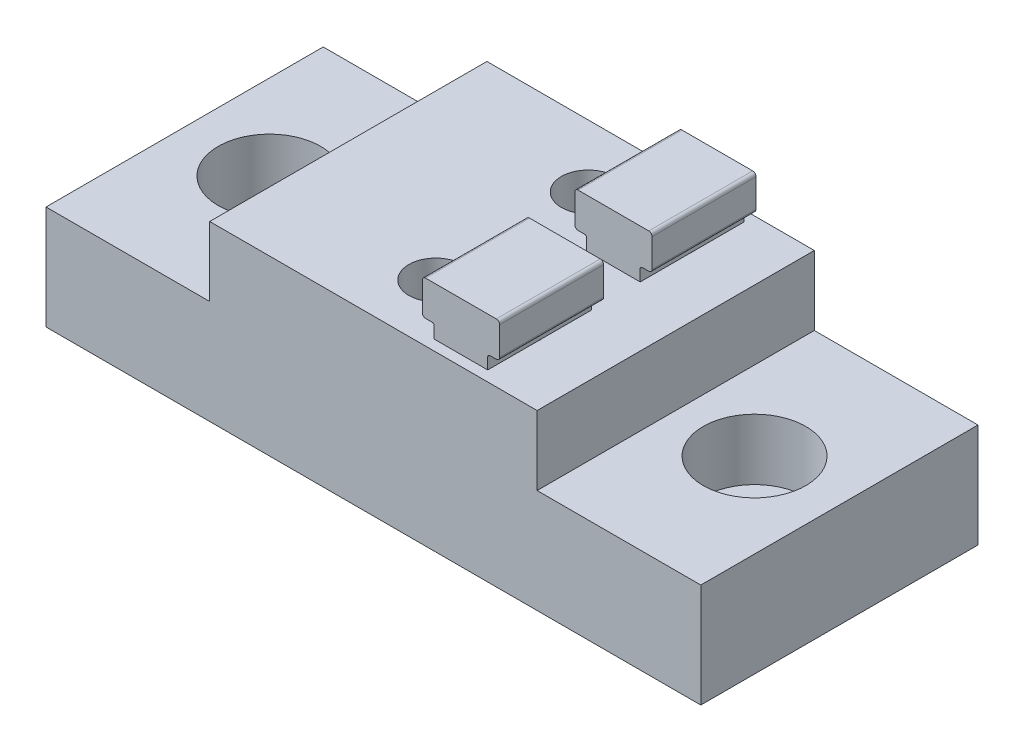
ISO-10303-21;
HEADER;
FILE_DESCRIPTION(('STEP AP214'),'2;1');
FILE_NAME('part.step','',(''),(''),'','','');
FILE_SCHEMA(('AUTOMOTIVE_DESIGN { 1 0 10303 214 1 1 1 1 }'));
ENDSEC;
DATA;
#1=APPLICATION_CONTEXT('core data for automotive mechanical design processes');
#2=APPLICATION_PROTOCOL_DEFINITION('international standard','automotive_design',2000,#1);
#3=PRODUCT_CONTEXT('',#1,'mechanical');
#4=PRODUCT('Part','Part','',(#3));
#5=PRODUCT_RELATED_PRODUCT_CATEGORY('part','',(#4));
#6=PRODUCT_DEFINITION_FORMATION('','',#4);
#7=PRODUCT_DEFINITION_CONTEXT('part definition',#1,'design');
#8=PRODUCT_DEFINITION('design','',#6,#7);
#9=PRODUCT_DEFINITION_SHAPE('','',#8);
#10=(LENGTH_UNIT() NAMED_UNIT(*) SI_UNIT(.MILLI.,.METRE.));
#11=(NAMED_UNIT(*) PLANE_ANGLE_UNIT() SI_UNIT($,.RADIAN.));
#12=(NAMED_UNIT(*) SI_UNIT($,.STERADIAN.) SOLID_ANGLE_UNIT());
#13=UNCERTAINTY_MEASURE_WITH_UNIT(LENGTH_MEASURE(1.E-05),#10,'distance_accuracy_value','');
#14=(GEOMETRIC_REPRESENTATION_CONTEXT(3) GLOBAL_UNCERTAINTY_ASSIGNED_CONTEXT((#13)) GLOBAL_UNIT_ASSIGNED_CONTEXT((#10,
#11,#12)) REPRESENTATION_CONTEXT('',''));
#15=CARTESIAN_POINT('',(0.,0.,0.));
#16=DIRECTION('',(0.,0.,1.));
#17=DIRECTION('',(1.,0.,0.));
#18=AXIS2_PLACEMENT_3D('',#15,#16,#17);
#19=CARTESIAN_POINT('',(-14.9987,0.,12.7));
#20=DIRECTION('',(-1.,0.,0.));
#21=DIRECTION('',(0.,0.,1.));
#22=AXIS2_PLACEMENT_3D('',#19,#20,#21);
#23=PLANE('',#22);
#24=DIRECTION('',(0.,1.,0.));
#25=VECTOR('',#24,1.);
#26=CARTESIAN_POINT('',(-14.9987,0.,-12.7));
#27=LINE('',#26,#25);
#28=CARTESIAN_POINT('',(-14.9987,9.525,-12.7));
#29=VERTEX_POINT('',#28);
#30=CARTESIAN_POINT('',(-14.9987,15.875,-12.7));
#31=VERTEX_POINT('',#30);
#32=EDGE_CURVE('E866',#29,#31,#27,.T.);
#33=ORIENTED_EDGE('',*,*,#32,.F.);
#34=DIRECTION('',(0.,0.,-1.));
#35=VECTOR('',#34,1.);
#36=CARTESIAN_POINT('',(-14.9987,9.525,12.7));
#37=LINE('',#36,#35);
#38=CARTESIAN_POINT('',(-14.9987,9.525,12.7));
#39=VERTEX_POINT('',#38);
#40=EDGE_CURVE('E901',#39,#29,#37,.T.);
#41=ORIENTED_EDGE('',*,*,#40,.F.);
#42=DIRECTION('',(0.,1.,0.));
#43=VECTOR('',#42,1.);
#44=CARTESIAN_POINT('',(-14.9987,0.,12.7));
#45=LINE('',#44,#43);
#46=CARTESIAN_POINT('',(-14.9987,15.875,12.7));
#47=VERTEX_POINT('',#46);
#48=EDGE_CURVE('E845',#39,#47,#45,.T.);
#49=ORIENTED_EDGE('',*,*,#48,.T.);
#50=DIRECTION('',(0.,0.,-1.));
#51=VECTOR('',#50,1.);
#52=CARTESIAN_POINT('',(-14.9987,15.875,12.7));
#53=LINE('',#52,#51);
#54=EDGE_CURVE('E865',#47,#31,#53,.T.);
#55=ORIENTED_EDGE('',*,*,#54,.T.);
#56=EDGE_LOOP('',(#33,#41,#49,#55));
#57=FACE_BOUND('',#56,.T.);
#58=ADVANCED_FACE('F38',(#57),#23,.T.);
#59=CARTESIAN_POINT('',(0.,9.525,12.7));
#60=DIRECTION('',(0.,1.,0.));
#61=DIRECTION('',(0.,0.,1.));
#62=AXIS2_PLACEMENT_3D('',#59,#60,#61);
#63=PLANE('',#62);
#64=CARTESIAN_POINT('',(-22.225,9.525,0.));
#65=DIRECTION('',(0.,1.,0.));
#66=DIRECTION('',(0.,0.,1.));
#67=AXIS2_PLACEMENT_3D('',#64,#65,#66);
#68=CIRCLE('',#67,4.699);
#69=CARTESIAN_POINT('',(-22.225,9.525,4.699));
#70=VERTEX_POINT('',#69);
#71=EDGE_CURVE('E790',#70,#70,#68,.T.);
#72=ORIENTED_EDGE('',*,*,#71,.F.);
#73=EDGE_LOOP('',(#72));
#74=FACE_BOUND('',#73,.T.);
#75=DIRECTION('',(1.,0.,0.));
#76=VECTOR('',#75,1.);
#77=CARTESIAN_POINT('',(0.,9.525,-12.7));
#78=LINE('',#77,#76);
#79=CARTESIAN_POINT('',(-30.,9.525,-12.7));
#80=VERTEX_POINT('',#79);
#81=EDGE_CURVE('E869',#80,#29,#78,.T.);
#82=ORIENTED_EDGE('',*,*,#81,.F.);
#83=DIRECTION('',(0.,0.,-1.));
#84=VECTOR('',#83,1.);
#85=CARTESIAN_POINT('',(-30.,9.525,12.7));
#86=LINE('',#85,#84);
#87=CARTESIAN_POINT('',(-30.,9.525,12.7));
#88=VERTEX_POINT('',#87);
#89=EDGE_CURVE('E899',#88,#80,#86,.T.);
#90=ORIENTED_EDGE('',*,*,#89,.F.);
#91=DIRECTION('',(1.,0.,0.));
#92=VECTOR('',#91,1.);
#93=CARTESIAN_POINT('',(0.,9.525,12.7));
#94=LINE('',#93,#92);
#95=EDGE_CURVE('E848',#88,#39,#94,.T.);
#96=ORIENTED_EDGE('',*,*,#95,.T.);
#97=ORIENTED_EDGE('',*,*,#40,.T.);
#98=EDGE_LOOP('',(#82,#90,#96,#97));
#99=FACE_BOUND('',#98,.T.);
#100=ADVANCED_FACE('F948',(#74,#99),#63,.T.);
#101=CARTESIAN_POINT('',(-30.,0.,12.7));
#102=DIRECTION('',(1.,0.,0.));
#103=DIRECTION('',(0.,0.,-1.));
#104=AXIS2_PLACEMENT_3D('',#101,#102,#103);
#105=PLANE('',#104);
#106=DIRECTION('',(0.,-1.,0.));
#107=VECTOR('',#106,1.);
#108=CARTESIAN_POINT('',(-30.,0.,-12.7));
#109=LINE('',#108,#107);
#110=CARTESIAN_POINT('',(-30.,0.,-12.7));
#111=VERTEX_POINT('',#110);
#112=EDGE_CURVE('E873',#80,#111,#109,.T.);
#113=ORIENTED_EDGE('',*,*,#112,.T.);
#114=DIRECTION('',(0.,0.,-1.));
#115=VECTOR('',#114,1.);
#116=CARTESIAN_POINT('',(-30.,0.,12.7));
#117=LINE('',#116,#115);
#118=CARTESIAN_POINT('',(-30.,0.,12.7));
#119=VERTEX_POINT('',#118);
#120=EDGE_CURVE('E896',#119,#111,#117,.T.);
#121=ORIENTED_EDGE('',*,*,#120,.F.);
#122=DIRECTION('',(0.,-1.,0.));
#123=VECTOR('',#122,1.);
#124=CARTESIAN_POINT('',(-30.,0.,12.7));
#125=LINE('',#124,#123);
#126=EDGE_CURVE('E852',#88,#119,#125,.T.);
#127=ORIENTED_EDGE('',*,*,#126,.F.);
#128=ORIENTED_EDGE('',*,*,#89,.T.);
#129=EDGE_LOOP('',(#113,#121,#127,#128));
#130=FACE_BOUND('',#129,.T.);
#131=ADVANCED_FACE('F954',(#130),#105,.F.);
#132=CARTESIAN_POINT('',(0.,0.,12.7));
#133=DIRECTION('',(0.,1.,0.));
#134=DIRECTION('',(0.,0.,1.));
#135=AXIS2_PLACEMENT_3D('',#132,#133,#134);
#136=PLANE('',#135);
#137=CARTESIAN_POINT('',(-22.225,0.,0.));
#138=DIRECTION('',(0.,1.,0.));
#139=DIRECTION('',(0.,0.,1.));
#140=AXIS2_PLACEMENT_3D('',#137,#138,#139);
#141=CIRCLE('',#140,2.8067);
#142=CARTESIAN_POINT('',(-22.225,0.,2.8067));
#143=VERTEX_POINT('',#142);
#144=EDGE_CURVE('E799',#143,#143,#141,.T.);
#145=ORIENTED_EDGE('',*,*,#144,.T.);
#146=EDGE_LOOP('',(#145));
#147=FACE_BOUND('',#146,.T.);
#148=CARTESIAN_POINT('',(22.225,0.,0.));
#149=DIRECTION('',(0.,1.,0.));
#150=DIRECTION('',(0.,0.,1.));
#151=AXIS2_PLACEMENT_3D('',#148,#149,#150);
#152=CIRCLE('',#151,2.8067);
#153=CARTESIAN_POINT('',(22.225,0.,2.8067));
#154=VERTEX_POINT('',#153);
#155=EDGE_CURVE('E809',#154,#154,#152,.T.);
#156=ORIENTED_EDGE('',*,*,#155,.T.);
#157=EDGE_LOOP('',(#156));
#158=FACE_BOUND('',#157,.T.);
#159=CARTESIAN_POINT('',(7.0713,0.,-6.985));
#160=DIRECTION('',(0.,-1.,0.));
#161=DIRECTION('',(0.,0.,-1.));
#162=AXIS2_PLACEMENT_3D('',#159,#160,#161);
#163=CIRCLE('',#162,3.937);
#164=CARTESIAN_POINT('',(7.0713,0.,-10.922));
#165=VERTEX_POINT('',#164);
#166=CARTESIAN_POINT('',(7.0713,0.,-3.048));
#167=VERTEX_POINT('',#166);
#168=EDGE_CURVE('E810',#165,#167,#163,.T.);
#169=ORIENTED_EDGE('',*,*,#168,.F.);
#170=DIRECTION('',(1.,0.,0.));
#171=VECTOR('',#170,1.);
#172=CARTESIAN_POINT('',(0.,0.,-10.922));
#173=LINE('',#172,#171);
#174=CARTESIAN_POINT('',(0.,0.,-10.922));
#175=VERTEX_POINT('',#174);
#176=EDGE_CURVE('E770',#175,#165,#173,.T.);
#177=ORIENTED_EDGE('',*,*,#176,.F.);
#178=CARTESIAN_POINT('',(0.,0.,-6.985));
#179=DIRECTION('',(0.,-1.,0.));
#180=DIRECTION('',(0.,0.,-1.));
#181=AXIS2_PLACEMENT_3D('',#178,#179,#180);
#182=CIRCLE('',#181,3.937);
#183=CARTESIAN_POINT('',(0.,0.,-3.048));
#184=VERTEX_POINT('',#183);
#185=EDGE_CURVE('E817',#184,#175,#182,.T.);
#186=ORIENTED_EDGE('',*,*,#185,.F.);
#187=DIRECTION('',(-1.,0.,0.));
#188=VECTOR('',#187,1.);
#189=CARTESIAN_POINT('',(0.,0.,-3.048));
#190=LINE('',#189,#188);
#191=EDGE_CURVE('E771',#167,#184,#190,.T.);
#192=ORIENTED_EDGE('',*,*,#191,.F.);
#193=EDGE_LOOP('',(#169,#177,#186,#192));
#194=FACE_BOUND('',#193,.T.);
#195=CARTESIAN_POINT('',(7.0713,0.,6.985));
#196=DIRECTION('',(0.,-1.,0.));
#197=DIRECTION('',(0.,0.,-1.));
#198=AXIS2_PLACEMENT_3D('',#195,#196,#197);
#199=CIRCLE('',#198,3.937);
#200=CARTESIAN_POINT('',(7.0713,0.,3.048));
#201=VERTEX_POINT('',#200);
#202=CARTESIAN_POINT('',(7.0713,0.,10.922));
#203=VERTEX_POINT('',#202);
#204=EDGE_CURVE('E838',#201,#203,#199,.T.);
#205=ORIENTED_EDGE('',*,*,#204,.F.);
#206=DIRECTION('',(1.,0.,0.));
#207=VECTOR('',#206,1.);
#208=CARTESIAN_POINT('',(0.,0.,3.048));
#209=LINE('',#208,#207);
#210=CARTESIAN_POINT('',(0.,0.,3.048));
#211=VERTEX_POINT('',#210);
#212=EDGE_CURVE('E750',#211,#201,#209,.T.);
#213=ORIENTED_EDGE('',*,*,#212,.F.);
#214=CARTESIAN_POINT('',(0.,0.,6.985));
#215=DIRECTION('',(0.,-1.,0.));
#216=DIRECTION('',(0.,0.,-1.));
#217=AXIS2_PLACEMENT_3D('',#214,#215,#216);
#218=CIRCLE('',#217,3.937);
#219=CARTESIAN_POINT('',(0.,0.,10.922));
#220=VERTEX_POINT('',#219);
#221=EDGE_CURVE('E828',#220,#211,#218,.T.);
#222=ORIENTED_EDGE('',*,*,#221,.F.);
#223=DIRECTION('',(-1.,0.,0.));
#224=VECTOR('',#223,1.);
#225=CARTESIAN_POINT('',(0.,0.,10.922));
#226=LINE('',#225,#224);
#227=EDGE_CURVE('E751',#203,#220,#226,.T.);
#228=ORIENTED_EDGE('',*,*,#227,.F.);
#229=EDGE_LOOP('',(#205,#213,#222,#228));
#230=FACE_BOUND('',#229,.T.);
#231=DIRECTION('',(1.,0.,0.));
#232=VECTOR('',#231,1.);
#233=CARTESIAN_POINT('',(0.,0.,-12.7));
#234=LINE('',#233,#232);
#235=CARTESIAN_POINT('',(30.,0.,-12.7));
#236=VERTEX_POINT('',#235);
#237=EDGE_CURVE('E876',#111,#236,#234,.T.);
#238=ORIENTED_EDGE('',*,*,#237,.T.);
#239=DIRECTION('',(0.,0.,-1.));
#240=VECTOR('',#239,1.);
#241=CARTESIAN_POINT('',(30.,0.,12.7));
#242=LINE('',#241,#240);
#243=CARTESIAN_POINT('',(30.,0.,12.7));
#244=VERTEX_POINT('',#243);
#245=EDGE_CURVE('E894',#244,#236,#242,.T.);
#246=ORIENTED_EDGE('',*,*,#245,.F.);
#247=DIRECTION('',(1.,0.,0.));
#248=VECTOR('',#247,1.);
#249=CARTESIAN_POINT('',(0.,0.,12.7));
#250=LINE('',#249,#248);
#251=EDGE_CURVE('E855',#119,#244,#250,.T.);
#252=ORIENTED_EDGE('',*,*,#251,.F.);
#253=ORIENTED_EDGE('',*,*,#120,.T.);
#254=EDGE_LOOP('',(#238,#246,#252,#253));
#255=FACE_BOUND('',#254,.T.);
#256=ADVANCED_FACE('F962',(#147,#158,#194,#230,#255),#136,.F.);
#257=CARTESIAN_POINT('',(30.,0.,12.7));
#258=DIRECTION('',(1.,0.,0.));
#259=DIRECTION('',(0.,0.,-1.));
#260=AXIS2_PLACEMENT_3D('',#257,#258,#259);
#261=PLANE('',#260);
#262=DIRECTION('',(0.,-1.,0.));
#263=VECTOR('',#262,1.);
#264=CARTESIAN_POINT('',(30.,0.,-12.7));
#265=LINE('',#264,#263);
#266=CARTESIAN_POINT('',(30.,9.525,-12.7));
#267=VERTEX_POINT('',#266);
#268=EDGE_CURVE('E879',#267,#236,#265,.T.);
#269=ORIENTED_EDGE('',*,*,#268,.F.);
#270=DIRECTION('',(0.,0.,-1.));
#271=VECTOR('',#270,1.);
#272=CARTESIAN_POINT('',(30.,9.525,12.7));
#273=LINE('',#272,#271);
#274=CARTESIAN_POINT('',(30.,9.525,12.7));
#275=VERTEX_POINT('',#274);
#276=EDGE_CURVE('E892',#275,#267,#273,.T.);
#277=ORIENTED_EDGE('',*,*,#276,.F.);
#278=DIRECTION('',(0.,-1.,0.));
#279=VECTOR('',#278,1.);
#280=CARTESIAN_POINT('',(30.,0.,12.7));
#281=LINE('',#280,#279);
#282=EDGE_CURVE('E857',#275,#244,#281,.T.);
#283=ORIENTED_EDGE('',*,*,#282,.T.);
#284=ORIENTED_EDGE('',*,*,#245,.T.);
#285=EDGE_LOOP('',(#269,#277,#283,#284));
#286=FACE_BOUND('',#285,.T.);
#287=ADVANCED_FACE('F966',(#286),#261,.T.);
#288=CARTESIAN_POINT('',(22.225,9.525,0.));
#289=DIRECTION('',(0.,1.,0.));
#290=DIRECTION('',(0.,0.,1.));
#291=AXIS2_PLACEMENT_3D('',#288,#289,#290);
#292=CIRCLE('',#291,4.699);
#293=CARTESIAN_POINT('',(22.225,9.525,4.699));
#294=VERTEX_POINT('',#293);
#295=EDGE_CURVE('E800',#294,#294,#292,.T.);
#296=ORIENTED_EDGE('',*,*,#295,.F.);
#297=EDGE_LOOP('',(#296));
#298=FACE_BOUND('',#297,.T.);
#299=CARTESIAN_POINT('',(15.0013,9.525,-12.7));
#300=VERTEX_POINT('',#299);
#301=EDGE_CURVE('E874',#300,#267,#78,.T.);
#302=ORIENTED_EDGE('',*,*,#301,.F.);
#303=DIRECTION('',(0.,0.,-1.));
#304=VECTOR('',#303,1.);
#305=CARTESIAN_POINT('',(15.0013,9.525,12.7));
#306=LINE('',#305,#304);
#307=CARTESIAN_POINT('',(15.0013,9.525,12.7));
#308=VERTEX_POINT('',#307);
#309=EDGE_CURVE('E890',#308,#300,#306,.T.);
#310=ORIENTED_EDGE('',*,*,#309,.F.);
#311=EDGE_CURVE('E853',#308,#275,#94,.T.);
#312=ORIENTED_EDGE('',*,*,#311,.T.);
#313=ORIENTED_EDGE('',*,*,#276,.T.);
#314=EDGE_LOOP('',(#302,#310,#312,#313));
#315=FACE_BOUND('',#314,.T.);
#316=ADVANCED_FACE('F957',(#298,#315),#63,.T.);
#317=CARTESIAN_POINT('',(15.0013,0.,12.7));
#318=DIRECTION('',(-1.,0.,0.));
#319=DIRECTION('',(0.,0.,1.));
#320=AXIS2_PLACEMENT_3D('',#317,#318,#319);
#321=PLANE('',#320);
#322=DIRECTION('',(0.,1.,0.));
#323=VECTOR('',#322,1.);
#324=CARTESIAN_POINT('',(15.0013,0.,-12.7));
#325=LINE('',#324,#323);
#326=CARTESIAN_POINT('',(15.0013,15.875,-12.7));
#327=VERTEX_POINT('',#326);
#328=EDGE_CURVE('E882',#300,#327,#325,.T.);
#329=ORIENTED_EDGE('',*,*,#328,.T.);
#330=DIRECTION('',(0.,0.,-1.));
#331=VECTOR('',#330,1.);
#332=CARTESIAN_POINT('',(15.0013,15.875,12.7));
#333=LINE('',#332,#331);
#334=CARTESIAN_POINT('',(15.0013,15.875,12.7));
#335=VERTEX_POINT('',#334);
#336=EDGE_CURVE('E888',#335,#327,#333,.T.);
#337=ORIENTED_EDGE('',*,*,#336,.F.);
#338=DIRECTION('',(0.,1.,0.));
#339=VECTOR('',#338,1.);
#340=CARTESIAN_POINT('',(15.0013,0.,12.7));
#341=LINE('',#340,#339);
#342=EDGE_CURVE('E860',#308,#335,#341,.T.);
#343=ORIENTED_EDGE('',*,*,#342,.F.);
#344=ORIENTED_EDGE('',*,*,#309,.T.);
#345=EDGE_LOOP('',(#329,#337,#343,#344));
#346=FACE_BOUND('',#345,.T.);
#347=ADVANCED_FACE('F972',(#346),#321,.F.);
#348=CARTESIAN_POINT('',(0.,15.875,12.7));
#349=DIRECTION('',(0.,1.,0.));
#350=DIRECTION('',(0.,0.,1.));
#351=AXIS2_PLACEMENT_3D('',#348,#349,#350);
#352=PLANE('',#351);
#353=DIRECTION('',(0.,0.,1.));
#354=VECTOR('',#353,1.);
#355=CARTESIAN_POINT('',(9.52239999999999,15.875,-11.7475));
#356=LINE('',#355,#354);
#357=CARTESIAN_POINT('',(9.52239999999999,15.875,-11.7475));
#358=VERTEX_POINT('',#357);
#359=CARTESIAN_POINT('',(9.52239999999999,15.875,-7.23483840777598));
#360=VERTEX_POINT('',#359);
#361=EDGE_CURVE('E615',#358,#360,#356,.T.);
#362=ORIENTED_EDGE('',*,*,#361,.T.);
#363=CARTESIAN_POINT('',(7.0713,15.875,-6.985));
#364=DIRECTION('',(0.,1.,0.));
#365=DIRECTION('',(0.,0.,1.));
#366=AXIS2_PLACEMENT_3D('',#363,#364,#365);
#367=CIRCLE('',#366,2.4638);
#368=CARTESIAN_POINT('',(9.52239999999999,15.875,-6.73516159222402));
#369=VERTEX_POINT('',#368);
#370=EDGE_CURVE('E821',#369,#360,#367,.T.);
#371=ORIENTED_EDGE('',*,*,#370,.F.);
#372=CARTESIAN_POINT('',(9.52239999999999,15.875,-2.2225));
#373=VERTEX_POINT('',#372);
#374=EDGE_CURVE('E619',#369,#373,#356,.T.);
#375=ORIENTED_EDGE('',*,*,#374,.T.);
#376=DIRECTION('',(1.,0.,0.));
#377=VECTOR('',#376,1.);
#378=CARTESIAN_POINT('',(4.62019999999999,15.875,-2.2225));
#379=LINE('',#378,#377);
#380=CARTESIAN_POINT('',(4.62019999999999,15.875,-2.2225));
#381=VERTEX_POINT('',#380);
#382=EDGE_CURVE('E608',#381,#373,#379,.T.);
#383=ORIENTED_EDGE('',*,*,#382,.F.);
#384=DIRECTION('',(0.,0.,1.));
#385=VECTOR('',#384,1.);
#386=CARTESIAN_POINT('',(4.62019999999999,15.875,-11.7475));
#387=LINE('',#386,#385);
#388=CARTESIAN_POINT('',(4.62019999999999,15.875,-6.73516159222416));
#389=VERTEX_POINT('',#388);
#390=EDGE_CURVE('E623',#389,#381,#387,.T.);
#391=ORIENTED_EDGE('',*,*,#390,.F.);
#392=CARTESIAN_POINT('',(4.62019999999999,15.875,-7.23483840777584));
#393=VERTEX_POINT('',#392);
#394=EDGE_CURVE('E2111',#393,#389,#367,.T.);
#395=ORIENTED_EDGE('',*,*,#394,.F.);
#396=CARTESIAN_POINT('',(4.62019999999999,15.875,-11.7475));
#397=VERTEX_POINT('',#396);
#398=EDGE_CURVE('E620',#397,#393,#387,.T.);
#399=ORIENTED_EDGE('',*,*,#398,.F.);
#400=DIRECTION('',(1.,0.,0.));
#401=VECTOR('',#400,1.);
#402=CARTESIAN_POINT('',(4.62019999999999,15.875,-11.7475));
#403=LINE('',#402,#401);
#404=EDGE_CURVE('E565',#397,#358,#403,.T.);
#405=ORIENTED_EDGE('',*,*,#404,.T.);
#406=EDGE_LOOP('',(#362,#371,#375,#383,#391,#395,#399,#405));
#407=FACE_BOUND('',#406,.T.);
#408=DIRECTION('',(0.,0.,-1.));
#409=VECTOR('',#408,1.);
#410=CARTESIAN_POINT('',(9.52239999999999,15.875,11.7475));
#411=LINE('',#410,#409);
#412=CARTESIAN_POINT('',(9.52239999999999,15.875,11.7475));
#413=VERTEX_POINT('',#412);
#414=CARTESIAN_POINT('',(9.52239999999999,15.875,7.23483840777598));
#415=VERTEX_POINT('',#414);
#416=EDGE_CURVE('E705',#413,#415,#411,.T.);
#417=ORIENTED_EDGE('',*,*,#416,.F.);
#418=DIRECTION('',(1.,0.,0.));
#419=VECTOR('',#418,1.);
#420=CARTESIAN_POINT('',(4.62019999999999,15.875,11.7475));
#421=LINE('',#420,#419);
#422=CARTESIAN_POINT('',(4.62019999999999,15.875,11.7475));
#423=VERTEX_POINT('',#422);
#424=EDGE_CURVE('E673',#423,#413,#421,.T.);
#425=ORIENTED_EDGE('',*,*,#424,.F.);
#426=DIRECTION('',(0.,0.,-1.));
#427=VECTOR('',#426,1.);
#428=CARTESIAN_POINT('',(4.62019999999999,15.875,11.7475));
#429=LINE('',#428,#427);
#430=CARTESIAN_POINT('',(4.62019999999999,15.875,7.23483840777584));
#431=VERTEX_POINT('',#430);
#432=EDGE_CURVE('E710',#423,#431,#429,.T.);
#433=ORIENTED_EDGE('',*,*,#432,.T.);
#434=CARTESIAN_POINT('',(7.0713,15.875,6.985));
#435=DIRECTION('',(0.,1.,0.));
#436=DIRECTION('',(0.,0.,1.));
#437=AXIS2_PLACEMENT_3D('',#434,#435,#436);
#438=CIRCLE('',#437,2.4638);
#439=CARTESIAN_POINT('',(4.62019999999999,15.875,6.73516159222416));
#440=VERTEX_POINT('',#439);
#441=EDGE_CURVE('E2046',#440,#431,#438,.T.);
#442=ORIENTED_EDGE('',*,*,#441,.F.);
#443=CARTESIAN_POINT('',(4.62019999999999,15.875,2.2225));
#444=VERTEX_POINT('',#443);
#445=EDGE_CURVE('E714',#440,#444,#429,.T.);
#446=ORIENTED_EDGE('',*,*,#445,.T.);
#447=DIRECTION('',(1.,0.,0.));
#448=VECTOR('',#447,1.);
#449=CARTESIAN_POINT('',(4.62019999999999,15.875,2.2225));
#450=LINE('',#449,#448);
#451=CARTESIAN_POINT('',(9.52239999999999,15.875,2.2225));
#452=VERTEX_POINT('',#451);
#453=EDGE_CURVE('E649',#444,#452,#450,.T.);
#454=ORIENTED_EDGE('',*,*,#453,.T.);
#455=CARTESIAN_POINT('',(9.52239999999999,15.875,6.73516159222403));
#456=VERTEX_POINT('',#455);
#457=EDGE_CURVE('E709',#456,#452,#411,.T.);
#458=ORIENTED_EDGE('',*,*,#457,.F.);
#459=EDGE_CURVE('E870',#415,#456,#438,.T.);
#460=ORIENTED_EDGE('',*,*,#459,.F.);
#461=EDGE_LOOP('',(#417,#425,#433,#442,#446,#454,#458,#460));
#462=FACE_BOUND('',#461,.T.);
#463=CARTESIAN_POINT('',(0.,15.875,-6.985));
#464=DIRECTION('',(0.,1.,0.));
#465=DIRECTION('',(0.,0.,1.));
#466=AXIS2_PLACEMENT_3D('',#463,#464,#465);
#467=CIRCLE('',#466,2.4638);
#468=CARTESIAN_POINT('',(0.,15.875,-4.5212));
#469=VERTEX_POINT('',#468);
#470=EDGE_CURVE('E827',#469,#469,#467,.T.);
#471=ORIENTED_EDGE('',*,*,#470,.F.);
#472=EDGE_LOOP('',(#471));
#473=FACE_BOUND('',#472,.T.);
#474=CARTESIAN_POINT('',(0.,15.875,6.985));
#475=DIRECTION('',(0.,1.,0.));
#476=DIRECTION('',(0.,0.,1.));
#477=AXIS2_PLACEMENT_3D('',#474,#475,#476);
#478=CIRCLE('',#477,2.4638);
#479=CARTESIAN_POINT('',(0.,15.875,9.4488));
#480=VERTEX_POINT('',#479);
#481=EDGE_CURVE('E837',#480,#480,#478,.T.);
#482=ORIENTED_EDGE('',*,*,#481,.F.);
#483=EDGE_LOOP('',(#482));
#484=FACE_BOUND('',#483,.T.);
#485=DIRECTION('',(1.,0.,0.));
#486=VECTOR('',#485,1.);
#487=CARTESIAN_POINT('',(0.,15.875,-12.7));
#488=LINE('',#487,#486);
#489=EDGE_CURVE('E849',#31,#327,#488,.T.);
#490=ORIENTED_EDGE('',*,*,#489,.F.);
#491=ORIENTED_EDGE('',*,*,#54,.F.);
#492=DIRECTION('',(1.,0.,0.));
#493=VECTOR('',#492,1.);
#494=CARTESIAN_POINT('',(0.,15.875,12.7));
#495=LINE('',#494,#493);
#496=EDGE_CURVE('E862',#47,#335,#495,.T.);
#497=ORIENTED_EDGE('',*,*,#496,.T.);
#498=ORIENTED_EDGE('',*,*,#336,.T.);
#499=EDGE_LOOP('',(#490,#491,#497,#498));
#500=FACE_BOUND('',#499,.T.);
#501=ADVANCED_FACE('F976',(#407,#462,#473,#484,#500),#352,.T.);
#502=CARTESIAN_POINT('',(0.,0.,12.7));
#503=DIRECTION('',(0.,0.,1.));
#504=DIRECTION('',(1.,0.,0.));
#505=AXIS2_PLACEMENT_3D('',#502,#503,#504);
#506=PLANE('',#505);
#507=ORIENTED_EDGE('',*,*,#48,.F.);
#508=ORIENTED_EDGE('',*,*,#95,.F.);
#509=ORIENTED_EDGE('',*,*,#126,.T.);
#510=ORIENTED_EDGE('',*,*,#251,.T.);
#511=ORIENTED_EDGE('',*,*,#282,.F.);
#512=ORIENTED_EDGE('',*,*,#311,.F.);
#513=ORIENTED_EDGE('',*,*,#342,.T.);
#514=ORIENTED_EDGE('',*,*,#496,.F.);
#515=EDGE_LOOP('',(#507,#508,#509,#510,#511,#512,#513,#514));
#516=FACE_BOUND('',#515,.T.);
#517=ADVANCED_FACE('F980',(#516),#506,.T.);
#518=CARTESIAN_POINT('',(0.,0.,-12.7));
#519=DIRECTION('',(0.,0.,1.));
#520=DIRECTION('',(1.,0.,0.));
#521=AXIS2_PLACEMENT_3D('',#518,#519,#520);
#522=PLANE('',#521);
#523=ORIENTED_EDGE('',*,*,#32,.T.);
#524=ORIENTED_EDGE('',*,*,#489,.T.);
#525=ORIENTED_EDGE('',*,*,#328,.F.);
#526=ORIENTED_EDGE('',*,*,#301,.T.);
#527=ORIENTED_EDGE('',*,*,#268,.T.);
#528=ORIENTED_EDGE('',*,*,#237,.F.);
#529=ORIENTED_EDGE('',*,*,#112,.F.);
#530=ORIENTED_EDGE('',*,*,#81,.T.);
#531=EDGE_LOOP('',(#523,#524,#525,#526,#527,#528,#529,#530));
#532=FACE_BOUND('',#531,.T.);
#533=ADVANCED_FACE('F982',(#532),#522,.F.);
#534=CARTESIAN_POINT('',(7.0713,0.,6.985));
#535=DIRECTION('',(0.,-1.,0.));
#536=DIRECTION('',(0.,0.,-1.));
#537=AXIS2_PLACEMENT_3D('',#534,#535,#536);
#538=CYLINDRICAL_SURFACE('',#537,2.4638);
#539=ORIENTED_EDGE('',*,*,#459,.T.);
#540=EDGE_CURVE('E905',#456,#440,#438,.T.);
#541=ORIENTED_EDGE('',*,*,#540,.T.);
#542=ORIENTED_EDGE('',*,*,#441,.T.);
#543=EDGE_CURVE('E844',#431,#415,#438,.T.);
#544=ORIENTED_EDGE('',*,*,#543,.T.);
#545=EDGE_LOOP('',(#539,#541,#542,#544));
#546=FACE_BOUND('',#545,.T.);
#547=CARTESIAN_POINT('',(7.0713,4.826,6.985));
#548=DIRECTION('',(0.,-1.,0.));
#549=DIRECTION('',(0.,0.,-1.));
#550=AXIS2_PLACEMENT_3D('',#547,#548,#549);
#551=CIRCLE('',#550,2.4638);
#552=CARTESIAN_POINT('',(7.0713,4.826,4.5212));
#553=VERTEX_POINT('',#552);
#554=EDGE_CURVE('E518',#553,#553,#551,.F.);
#555=ORIENTED_EDGE('',*,*,#554,.F.);
#556=EDGE_LOOP('',(#555));
#557=FACE_BOUND('',#556,.T.);
#558=ADVANCED_FACE('F985',(#546,#557),#538,.F.);
#559=CARTESIAN_POINT('',(9.5351,4.826,6.985));
#560=DIRECTION('',(0.,1.,0.));
#561=DIRECTION('',(0.,0.,1.));
#562=AXIS2_PLACEMENT_3D('',#559,#560,#561);
#563=PLANE('',#562);
#564=CARTESIAN_POINT('',(7.0713,4.826,6.985));
#565=DIRECTION('',(0.,1.,0.));
#566=DIRECTION('',(0.,0.,1.));
#567=AXIS2_PLACEMENT_3D('',#564,#565,#566);
#568=CIRCLE('',#567,3.5);
#569=CARTESIAN_POINT('',(7.0713,4.826,10.485));
#570=VERTEX_POINT('',#569);
#571=EDGE_CURVE('E922',#570,#570,#568,.F.);
#572=ORIENTED_EDGE('',*,*,#571,.F.);
#573=EDGE_LOOP('',(#572));
#574=FACE_BOUND('',#573,.T.);
#575=CARTESIAN_POINT('',(0.,4.826,6.985));
#576=DIRECTION('',(0.,-1.,0.));
#577=DIRECTION('',(0.,0.,-1.));
#578=AXIS2_PLACEMENT_3D('',#575,#576,#577);
#579=CIRCLE('',#578,2.4638);
#580=CARTESIAN_POINT('',(0.,4.826,4.5212));
#581=VERTEX_POINT('',#580);
#582=EDGE_CURVE('E834',#581,#581,#579,.T.);
#583=ORIENTED_EDGE('',*,*,#582,.F.);
#584=EDGE_LOOP('',(#583));
#585=FACE_BOUND('',#584,.T.);
#586=CARTESIAN_POINT('',(0.,4.826,6.985));
#587=DIRECTION('',(0.,-1.,0.));
#588=DIRECTION('',(0.,0.,-1.));
#589=AXIS2_PLACEMENT_3D('',#586,#587,#588);
#590=CIRCLE('',#589,3.937);
#591=CARTESIAN_POINT('',(0.,4.826,10.922));
#592=VERTEX_POINT('',#591);
#593=CARTESIAN_POINT('',(0.,4.826,3.048));
#594=VERTEX_POINT('',#593);
#595=EDGE_CURVE('E831',#592,#594,#590,.T.);
#596=ORIENTED_EDGE('',*,*,#595,.T.);
#597=DIRECTION('',(1.,0.,0.));
#598=VECTOR('',#597,1.);
#599=CARTESIAN_POINT('',(0.,4.826,3.048));
#600=LINE('',#599,#598);
#601=CARTESIAN_POINT('',(7.0713,4.826,3.048));
#602=VERTEX_POINT('',#601);
#603=EDGE_CURVE('E753',#594,#602,#600,.T.);
#604=ORIENTED_EDGE('',*,*,#603,.T.);
#605=CARTESIAN_POINT('',(7.0713,4.826,6.985));
#606=DIRECTION('',(0.,-1.,0.));
#607=DIRECTION('',(0.,0.,-1.));
#608=AXIS2_PLACEMENT_3D('',#605,#606,#607);
#609=CIRCLE('',#608,3.937);
#610=CARTESIAN_POINT('',(7.0713,4.826,10.922));
#611=VERTEX_POINT('',#610);
#612=EDGE_CURVE('E841',#602,#611,#609,.T.);
#613=ORIENTED_EDGE('',*,*,#612,.T.);
#614=DIRECTION('',(-1.,0.,0.));
#615=VECTOR('',#614,1.);
#616=CARTESIAN_POINT('',(0.,4.826,10.922));
#617=LINE('',#616,#615);
#618=EDGE_CURVE('E758',#611,#592,#617,.T.);
#619=ORIENTED_EDGE('',*,*,#618,.T.);
#620=EDGE_LOOP('',(#596,#604,#613,#619));
#621=FACE_BOUND('',#620,.T.);
#622=ADVANCED_FACE('F992',(#574,#585,#621),#563,.F.);
#623=CARTESIAN_POINT('',(7.0713,0.,6.985));
#624=DIRECTION('',(0.,-1.,0.));
#625=DIRECTION('',(0.,0.,-1.));
#626=AXIS2_PLACEMENT_3D('',#623,#624,#625);
#627=CYLINDRICAL_SURFACE('',#626,3.937);
#628=ORIENTED_EDGE('',*,*,#612,.F.);
#629=DIRECTION('',(0.,-1.,0.));
#630=VECTOR('',#629,1.);
#631=CARTESIAN_POINT('',(7.0713,15.4091545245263,3.048));
#632=LINE('',#631,#630);
#633=EDGE_CURVE('E757',#602,#201,#632,.T.);
#634=ORIENTED_EDGE('',*,*,#633,.T.);
#635=ORIENTED_EDGE('',*,*,#204,.T.);
#636=DIRECTION('',(0.,-1.,0.));
#637=VECTOR('',#636,1.);
#638=CARTESIAN_POINT('',(7.0713,15.4091545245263,10.922));
#639=LINE('',#638,#637);
#640=EDGE_CURVE('E762',#611,#203,#639,.T.);
#641=ORIENTED_EDGE('',*,*,#640,.F.);
#642=EDGE_LOOP('',(#628,#634,#635,#641));
#643=FACE_BOUND('',#642,.T.);
#644=ADVANCED_FACE('F996',(#643),#627,.F.);
#645=CARTESIAN_POINT('',(0.,0.,6.985));
#646=DIRECTION('',(0.,-1.,0.));
#647=DIRECTION('',(0.,0.,-1.));
#648=AXIS2_PLACEMENT_3D('',#645,#646,#647);
#649=CYLINDRICAL_SURFACE('',#648,3.937);
#650=ORIENTED_EDGE('',*,*,#221,.T.);
#651=DIRECTION('',(0.,-1.,0.));
#652=VECTOR('',#651,1.);
#653=CARTESIAN_POINT('',(0.,15.4091545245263,3.048));
#654=LINE('',#653,#652);
#655=EDGE_CURVE('E765',#594,#211,#654,.T.);
#656=ORIENTED_EDGE('',*,*,#655,.F.);
#657=ORIENTED_EDGE('',*,*,#595,.F.);
#658=DIRECTION('',(0.,-1.,0.));
#659=VECTOR('',#658,1.);
#660=CARTESIAN_POINT('',(0.,15.4091545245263,10.922));
#661=LINE('',#660,#659);
#662=EDGE_CURVE('E761',#592,#220,#661,.T.);
#663=ORIENTED_EDGE('',*,*,#662,.T.);
#664=EDGE_LOOP('',(#650,#656,#657,#663));
#665=FACE_BOUND('',#664,.T.);
#666=ADVANCED_FACE('F1000',(#665),#649,.F.);
#667=CARTESIAN_POINT('',(0.,0.,6.985));
#668=DIRECTION('',(0.,-1.,0.));
#669=DIRECTION('',(0.,0.,-1.));
#670=AXIS2_PLACEMENT_3D('',#667,#668,#669);
#671=CYLINDRICAL_SURFACE('',#670,2.4638);
#672=ORIENTED_EDGE('',*,*,#481,.T.);
#673=EDGE_LOOP('',(#672));
#674=FACE_BOUND('',#673,.T.);
#675=ORIENTED_EDGE('',*,*,#582,.T.);
#676=EDGE_LOOP('',(#675));
#677=FACE_BOUND('',#676,.T.);
#678=ADVANCED_FACE('F1002',(#674,#677),#671,.F.);
#679=CARTESIAN_POINT('',(0.,0.,-6.985));
#680=DIRECTION('',(0.,-1.,0.));
#681=DIRECTION('',(0.,0.,-1.));
#682=AXIS2_PLACEMENT_3D('',#679,#680,#681);
#683=CYLINDRICAL_SURFACE('',#682,2.4638);
#684=ORIENTED_EDGE('',*,*,#470,.T.);
#685=EDGE_LOOP('',(#684));
#686=FACE_BOUND('',#685,.T.);
#687=CARTESIAN_POINT('',(0.,4.826,-6.985));
#688=DIRECTION('',(0.,-1.,0.));
#689=DIRECTION('',(0.,0.,-1.));
#690=AXIS2_PLACEMENT_3D('',#687,#688,#689);
#691=CIRCLE('',#690,2.4638);
#692=CARTESIAN_POINT('',(0.,4.826,-9.4488));
#693=VERTEX_POINT('',#692);
#694=EDGE_CURVE('E824',#693,#693,#691,.T.);
#695=ORIENTED_EDGE('',*,*,#694,.T.);
#696=EDGE_LOOP('',(#695));
#697=FACE_BOUND('',#696,.T.);
#698=ADVANCED_FACE('F1005',(#686,#697),#683,.F.);
#699=CARTESIAN_POINT('',(2.4638,4.826,-6.985));
#700=DIRECTION('',(0.,1.,0.));
#701=DIRECTION('',(0.,0.,1.));
#702=AXIS2_PLACEMENT_3D('',#699,#700,#701);
#703=PLANE('',#702);
#704=CARTESIAN_POINT('',(7.0713,4.826,-6.985));
#705=DIRECTION('',(0.,1.,0.));
#706=DIRECTION('',(0.,0.,1.));
#707=AXIS2_PLACEMENT_3D('',#704,#705,#706);
#708=CIRCLE('',#707,3.5);
#709=CARTESIAN_POINT('',(7.0713,4.826,-3.485));
#710=VERTEX_POINT('',#709);
#711=EDGE_CURVE('E925',#710,#710,#708,.F.);
#712=ORIENTED_EDGE('',*,*,#711,.F.);
#713=EDGE_LOOP('',(#712));
#714=FACE_BOUND('',#713,.T.);
#715=ORIENTED_EDGE('',*,*,#694,.F.);
#716=EDGE_LOOP('',(#715));
#717=FACE_BOUND('',#716,.T.);
#718=CARTESIAN_POINT('',(0.,4.826,-6.985));
#719=DIRECTION('',(0.,-1.,0.));
#720=DIRECTION('',(0.,0.,-1.));
#721=AXIS2_PLACEMENT_3D('',#718,#719,#720);
#722=CIRCLE('',#721,3.937);
#723=CARTESIAN_POINT('',(0.,4.826,-3.048));
#724=VERTEX_POINT('',#723);
#725=CARTESIAN_POINT('',(0.,4.826,-10.922));
#726=VERTEX_POINT('',#725);
#727=EDGE_CURVE('E820',#724,#726,#722,.T.);
#728=ORIENTED_EDGE('',*,*,#727,.T.);
#729=DIRECTION('',(1.,0.,0.));
#730=VECTOR('',#729,1.);
#731=CARTESIAN_POINT('',(0.,4.826,-10.922));
#732=LINE('',#731,#730);
#733=CARTESIAN_POINT('',(7.0713,4.826,-10.922));
#734=VERTEX_POINT('',#733);
#735=EDGE_CURVE('E773',#726,#734,#732,.T.);
#736=ORIENTED_EDGE('',*,*,#735,.T.);
#737=CARTESIAN_POINT('',(7.0713,4.826,-6.985));
#738=DIRECTION('',(0.,-1.,0.));
#739=DIRECTION('',(0.,0.,-1.));
#740=AXIS2_PLACEMENT_3D('',#737,#738,#739);
#741=CIRCLE('',#740,3.937);
#742=CARTESIAN_POINT('',(7.0713,4.826,-3.048));
#743=VERTEX_POINT('',#742);
#744=EDGE_CURVE('E813',#734,#743,#741,.T.);
#745=ORIENTED_EDGE('',*,*,#744,.T.);
#746=DIRECTION('',(-1.,0.,0.));
#747=VECTOR('',#746,1.);
#748=CARTESIAN_POINT('',(0.,4.826,-3.048));
#749=LINE('',#748,#747);
#750=EDGE_CURVE('E778',#743,#724,#749,.T.);
#751=ORIENTED_EDGE('',*,*,#750,.T.);
#752=EDGE_LOOP('',(#728,#736,#745,#751));
#753=FACE_BOUND('',#752,.T.);
#754=ADVANCED_FACE('F1012',(#714,#717,#753),#703,.F.);
#755=CARTESIAN_POINT('',(0.,0.,-6.985));
#756=DIRECTION('',(0.,-1.,0.));
#757=DIRECTION('',(0.,0.,-1.));
#758=AXIS2_PLACEMENT_3D('',#755,#756,#757);
#759=CYLINDRICAL_SURFACE('',#758,3.937);
#760=ORIENTED_EDGE('',*,*,#185,.T.);
#761=DIRECTION('',(0.,-1.,0.));
#762=VECTOR('',#761,1.);
#763=CARTESIAN_POINT('',(0.,15.4091545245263,-10.922));
#764=LINE('',#763,#762);
#765=EDGE_CURVE('E785',#726,#175,#764,.T.);
#766=ORIENTED_EDGE('',*,*,#765,.F.);
#767=ORIENTED_EDGE('',*,*,#727,.F.);
#768=DIRECTION('',(0.,-1.,0.));
#769=VECTOR('',#768,1.);
#770=CARTESIAN_POINT('',(0.,15.4091545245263,-3.048));
#771=LINE('',#770,#769);
#772=EDGE_CURVE('E781',#724,#184,#771,.T.);
#773=ORIENTED_EDGE('',*,*,#772,.T.);
#774=EDGE_LOOP('',(#760,#766,#767,#773));
#775=FACE_BOUND('',#774,.T.);
#776=ADVANCED_FACE('F1016',(#775),#759,.F.);
#777=CARTESIAN_POINT('',(7.0713,0.,-6.985));
#778=DIRECTION('',(0.,-1.,0.));
#779=DIRECTION('',(0.,0.,-1.));
#780=AXIS2_PLACEMENT_3D('',#777,#778,#779);
#781=CYLINDRICAL_SURFACE('',#780,3.937);
#782=ORIENTED_EDGE('',*,*,#744,.F.);
#783=DIRECTION('',(0.,-1.,0.));
#784=VECTOR('',#783,1.);
#785=CARTESIAN_POINT('',(7.0713,15.4091545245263,-10.922));
#786=LINE('',#785,#784);
#787=EDGE_CURVE('E777',#734,#165,#786,.T.);
#788=ORIENTED_EDGE('',*,*,#787,.T.);
#789=ORIENTED_EDGE('',*,*,#168,.T.);
#790=DIRECTION('',(0.,-1.,0.));
#791=VECTOR('',#790,1.);
#792=CARTESIAN_POINT('',(7.0713,15.4091545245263,-3.048));
#793=LINE('',#792,#791);
#794=EDGE_CURVE('E782',#743,#167,#793,.T.);
#795=ORIENTED_EDGE('',*,*,#794,.F.);
#796=EDGE_LOOP('',(#782,#788,#789,#795));
#797=FACE_BOUND('',#796,.T.);
#798=ADVANCED_FACE('F1020',(#797),#781,.F.);
#799=CARTESIAN_POINT('',(7.0713,0.,-6.985));
#800=DIRECTION('',(0.,-1.,0.));
#801=DIRECTION('',(0.,0.,-1.));
#802=AXIS2_PLACEMENT_3D('',#799,#800,#801);
#803=CYLINDRICAL_SURFACE('',#802,2.4638);
#804=ORIENTED_EDGE('',*,*,#370,.T.);
#805=EDGE_CURVE('E912',#360,#393,#367,.T.);
#806=ORIENTED_EDGE('',*,*,#805,.T.);
#807=ORIENTED_EDGE('',*,*,#394,.T.);
#808=EDGE_CURVE('E816',#389,#369,#367,.T.);
#809=ORIENTED_EDGE('',*,*,#808,.T.);
#810=EDGE_LOOP('',(#804,#806,#807,#809));
#811=FACE_BOUND('',#810,.T.);
#812=CARTESIAN_POINT('',(7.0713,4.826,-6.985));
#813=DIRECTION('',(0.,-1.,0.));
#814=DIRECTION('',(0.,0.,-1.));
#815=AXIS2_PLACEMENT_3D('',#812,#813,#814);
#816=CIRCLE('',#815,2.4638);
#817=CARTESIAN_POINT('',(7.0713,4.826,-9.4488));
#818=VERTEX_POINT('',#817);
#819=EDGE_CURVE('E463',#818,#818,#816,.F.);
#820=ORIENTED_EDGE('',*,*,#819,.F.);
#821=EDGE_LOOP('',(#820));
#822=FACE_BOUND('',#821,.T.);
#823=ADVANCED_FACE('F1022',(#811,#822),#803,.F.);
#824=CARTESIAN_POINT('',(22.225,9.525,0.));
#825=DIRECTION('',(0.,1.,0.));
#826=DIRECTION('',(0.,0.,1.));
#827=AXIS2_PLACEMENT_3D('',#824,#825,#826);
#828=CYLINDRICAL_SURFACE('',#827,2.8067);
#829=CARTESIAN_POINT('',(22.225,3.937,0.));
#830=DIRECTION('',(0.,1.,0.));
#831=DIRECTION('',(0.,0.,1.));
#832=AXIS2_PLACEMENT_3D('',#829,#830,#831);
#833=CIRCLE('',#832,2.8067);
#834=CARTESIAN_POINT('',(22.225,3.937,2.8067));
#835=VERTEX_POINT('',#834);
#836=EDGE_CURVE('E806',#835,#835,#833,.T.);
#837=ORIENTED_EDGE('',*,*,#836,.T.);
#838=EDGE_LOOP('',(#837));
#839=FACE_BOUND('',#838,.T.);
#840=ORIENTED_EDGE('',*,*,#155,.F.);
#841=EDGE_LOOP('',(#840));
#842=FACE_BOUND('',#841,.T.);
#843=ADVANCED_FACE('F1025',(#839,#842),#828,.F.);
#844=CARTESIAN_POINT('',(25.0317,3.937,0.));
#845=DIRECTION('',(0.,-1.,0.));
#846=DIRECTION('',(0.,0.,-1.));
#847=AXIS2_PLACEMENT_3D('',#844,#845,#846);
#848=PLANE('',#847);
#849=ORIENTED_EDGE('',*,*,#836,.F.);
#850=EDGE_LOOP('',(#849));
#851=FACE_BOUND('',#850,.T.);
#852=CARTESIAN_POINT('',(22.225,3.937,0.));
#853=DIRECTION('',(0.,1.,0.));
#854=DIRECTION('',(0.,0.,1.));
#855=AXIS2_PLACEMENT_3D('',#852,#853,#854);
#856=CIRCLE('',#855,4.699);
#857=CARTESIAN_POINT('',(22.225,3.937,4.699));
#858=VERTEX_POINT('',#857);
#859=EDGE_CURVE('E803',#858,#858,#856,.T.);
#860=ORIENTED_EDGE('',*,*,#859,.T.);
#861=EDGE_LOOP('',(#860));
#862=FACE_BOUND('',#861,.T.);
#863=ADVANCED_FACE('F1032',(#851,#862),#848,.F.);
#864=CARTESIAN_POINT('',(22.225,9.525,0.));
#865=DIRECTION('',(0.,1.,0.));
#866=DIRECTION('',(0.,0.,1.));
#867=AXIS2_PLACEMENT_3D('',#864,#865,#866);
#868=CYLINDRICAL_SURFACE('',#867,4.699);
#869=ORIENTED_EDGE('',*,*,#859,.F.);
#870=EDGE_LOOP('',(#869));
#871=FACE_BOUND('',#870,.T.);
#872=ORIENTED_EDGE('',*,*,#295,.T.);
#873=EDGE_LOOP('',(#872));
#874=FACE_BOUND('',#873,.T.);
#875=ADVANCED_FACE('F1036',(#871,#874),#868,.F.);
#876=CARTESIAN_POINT('',(-22.225,9.525,0.));
#877=DIRECTION('',(0.,1.,0.));
#878=DIRECTION('',(0.,0.,1.));
#879=AXIS2_PLACEMENT_3D('',#876,#877,#878);
#880=CYLINDRICAL_SURFACE('',#879,2.8067);
#881=CARTESIAN_POINT('',(-22.225,3.937,0.));
#882=DIRECTION('',(0.,1.,0.));
#883=DIRECTION('',(0.,0.,1.));
#884=AXIS2_PLACEMENT_3D('',#881,#882,#883);
#885=CIRCLE('',#884,2.8067);
#886=CARTESIAN_POINT('',(-22.225,3.937,2.8067));
#887=VERTEX_POINT('',#886);
#888=EDGE_CURVE('E796',#887,#887,#885,.T.);
#889=ORIENTED_EDGE('',*,*,#888,.T.);
#890=EDGE_LOOP('',(#889));
#891=FACE_BOUND('',#890,.T.);
#892=ORIENTED_EDGE('',*,*,#144,.F.);
#893=EDGE_LOOP('',(#892));
#894=FACE_BOUND('',#893,.T.);
#895=ADVANCED_FACE('F1040',(#891,#894),#880,.F.);
#896=CARTESIAN_POINT('',(-19.4183,3.937,0.));
#897=DIRECTION('',(0.,-1.,0.));
#898=DIRECTION('',(0.,0.,-1.));
#899=AXIS2_PLACEMENT_3D('',#896,#897,#898);
#900=PLANE('',#899);
#901=ORIENTED_EDGE('',*,*,#888,.F.);
#902=EDGE_LOOP('',(#901));
#903=FACE_BOUND('',#902,.T.);
#904=CARTESIAN_POINT('',(-22.225,3.937,0.));
#905=DIRECTION('',(0.,1.,0.));
#906=DIRECTION('',(0.,0.,1.));
#907=AXIS2_PLACEMENT_3D('',#904,#905,#906);
#908=CIRCLE('',#907,4.699);
#909=CARTESIAN_POINT('',(-22.225,3.937,4.699));
#910=VERTEX_POINT('',#909);
#911=EDGE_CURVE('E793',#910,#910,#908,.T.);
#912=ORIENTED_EDGE('',*,*,#911,.T.);
#913=EDGE_LOOP('',(#912));
#914=FACE_BOUND('',#913,.T.);
#915=ADVANCED_FACE('F1044',(#903,#914),#900,.F.);
#916=CARTESIAN_POINT('',(-22.225,9.525,0.));
#917=DIRECTION('',(0.,1.,0.));
#918=DIRECTION('',(0.,0.,1.));
#919=AXIS2_PLACEMENT_3D('',#916,#917,#918);
#920=CYLINDRICAL_SURFACE('',#919,4.699);
#921=ORIENTED_EDGE('',*,*,#911,.F.);
#922=EDGE_LOOP('',(#921));
#923=FACE_BOUND('',#922,.T.);
#924=ORIENTED_EDGE('',*,*,#71,.T.);
#925=EDGE_LOOP('',(#924));
#926=FACE_BOUND('',#925,.T.);
#927=ADVANCED_FACE('F1048',(#923,#926),#920,.F.);
#928=CARTESIAN_POINT('',(0.,15.4091545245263,-3.048));
#929=DIRECTION('',(0.,0.,1.));
#930=DIRECTION('',(1.,0.,0.));
#931=AXIS2_PLACEMENT_3D('',#928,#929,#930);
#932=PLANE('',#931);
#933=ORIENTED_EDGE('',*,*,#794,.T.);
#934=ORIENTED_EDGE('',*,*,#191,.T.);
#935=ORIENTED_EDGE('',*,*,#772,.F.);
#936=ORIENTED_EDGE('',*,*,#750,.F.);
#937=EDGE_LOOP('',(#933,#934,#935,#936));
#938=FACE_BOUND('',#937,.T.);
#939=ADVANCED_FACE('F1052',(#938),#932,.F.);
#940=CARTESIAN_POINT('',(0.,15.4091545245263,-10.922));
#941=DIRECTION('',(0.,0.,-1.));
#942=DIRECTION('',(-1.,0.,0.));
#943=AXIS2_PLACEMENT_3D('',#940,#941,#942);
#944=PLANE('',#943);
#945=ORIENTED_EDGE('',*,*,#765,.T.);
#946=ORIENTED_EDGE('',*,*,#176,.T.);
#947=ORIENTED_EDGE('',*,*,#787,.F.);
#948=ORIENTED_EDGE('',*,*,#735,.F.);
#949=EDGE_LOOP('',(#945,#946,#947,#948));
#950=FACE_BOUND('',#949,.T.);
#951=ADVANCED_FACE('F1054',(#950),#944,.F.);
#952=CARTESIAN_POINT('',(0.,15.4091545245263,10.922));
#953=DIRECTION('',(0.,0.,1.));
#954=DIRECTION('',(1.,0.,0.));
#955=AXIS2_PLACEMENT_3D('',#952,#953,#954);
#956=PLANE('',#955);
#957=ORIENTED_EDGE('',*,*,#640,.T.);
#958=ORIENTED_EDGE('',*,*,#227,.T.);
#959=ORIENTED_EDGE('',*,*,#662,.F.);
#960=ORIENTED_EDGE('',*,*,#618,.F.);
#961=EDGE_LOOP('',(#957,#958,#959,#960));
#962=FACE_BOUND('',#961,.T.);
#963=ADVANCED_FACE('F1057',(#962),#956,.F.);
#964=CARTESIAN_POINT('',(0.,15.4091545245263,3.048));
#965=DIRECTION('',(0.,0.,-1.));
#966=DIRECTION('',(-1.,0.,0.));
#967=AXIS2_PLACEMENT_3D('',#964,#965,#966);
#968=PLANE('',#967);
#969=ORIENTED_EDGE('',*,*,#655,.T.);
#970=ORIENTED_EDGE('',*,*,#212,.T.);
#971=ORIENTED_EDGE('',*,*,#633,.F.);
#972=ORIENTED_EDGE('',*,*,#603,.F.);
#973=EDGE_LOOP('',(#969,#970,#971,#972));
#974=FACE_BOUND('',#973,.T.);
#975=ADVANCED_FACE('F1062',(#974),#968,.F.);
#976=CARTESIAN_POINT('',(9.52239999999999,16.91628,11.7475));
#977=DIRECTION('',(-1.,0.,0.));
#978=DIRECTION('',(0.,-1.,0.));
#979=AXIS2_PLACEMENT_3D('',#976,#977,#978);
#980=PLANE('',#979);
#981=DIRECTION('',(0.,1.,0.));
#982=VECTOR('',#981,1.);
#983=CARTESIAN_POINT('',(9.52239999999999,16.91628,2.2225));
#984=LINE('',#983,#982);
#985=CARTESIAN_POINT('',(9.52239999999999,16.91628,2.2225));
#986=VERTEX_POINT('',#985);
#987=EDGE_CURVE('E614',#452,#986,#984,.T.);
#988=ORIENTED_EDGE('',*,*,#987,.T.);
#989=DIRECTION('',(0.,0.,-1.));
#990=VECTOR('',#989,1.);
#991=CARTESIAN_POINT('',(9.52239999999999,16.91628,11.7475));
#992=LINE('',#991,#990);
#993=CARTESIAN_POINT('',(9.52239999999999,16.91628,11.7475));
#994=VERTEX_POINT('',#993);
#995=EDGE_CURVE('E747',#994,#986,#992,.T.);
#996=ORIENTED_EDGE('',*,*,#995,.F.);
#997=DIRECTION('',(0.,1.,0.));
#998=VECTOR('',#997,1.);
#999=CARTESIAN_POINT('',(9.52239999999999,16.91628,11.7475));
#1000=LINE('',#999,#998);
#1001=EDGE_CURVE('E645',#413,#994,#1000,.T.);
#1002=ORIENTED_EDGE('',*,*,#1001,.F.);
#1003=ORIENTED_EDGE('',*,*,#416,.T.);
#1004=EDGE_CURVE('E675',#415,#456,#411,.T.);
#1005=ORIENTED_EDGE('',*,*,#1004,.T.);
#1006=ORIENTED_EDGE('',*,*,#457,.T.);
#1007=EDGE_LOOP('',(#988,#996,#1002,#1003,#1005,#1006));
#1008=FACE_BOUND('',#1007,.T.);
#1009=ADVANCED_FACE('F1065',(#1008),#980,.F.);
#1010=CARTESIAN_POINT('',(9.72559999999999,16.91628,11.7475));
#1011=DIRECTION('',(0.,0.,-1.));
#1012=DIRECTION('',(-1.,0.,0.));
#1013=AXIS2_PLACEMENT_3D('',#1010,#1011,#1012);
#1014=CYLINDRICAL_SURFACE('',#1013,0.203200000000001);
#1015=CARTESIAN_POINT('',(9.72559999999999,16.91628,2.2225));
#1016=DIRECTION('',(0.,0.,-1.));
#1017=DIRECTION('',(1.,0.,0.));
#1018=AXIS2_PLACEMENT_3D('',#1015,#1016,#1017);
#1019=CIRCLE('',#1018,0.203200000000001);
#1020=CARTESIAN_POINT('',(9.72559999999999,17.11948,2.2225));
#1021=VERTEX_POINT('',#1020);
#1022=EDGE_CURVE('E678',#986,#1021,#1019,.T.);
#1023=ORIENTED_EDGE('',*,*,#1022,.T.);
#1024=DIRECTION('',(0.,0.,-1.));
#1025=VECTOR('',#1024,1.);
#1026=CARTESIAN_POINT('',(9.72559999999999,17.11948,11.7475));
#1027=LINE('',#1026,#1025);
#1028=CARTESIAN_POINT('',(9.72559999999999,17.11948,11.7475));
#1029=VERTEX_POINT('',#1028);
#1030=EDGE_CURVE('E744',#1029,#1021,#1027,.T.);
#1031=ORIENTED_EDGE('',*,*,#1030,.F.);
#1032=CARTESIAN_POINT('',(9.72559999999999,16.91628,11.7475));
#1033=DIRECTION('',(0.,0.,-1.));
#1034=DIRECTION('',(1.,0.,0.));
#1035=AXIS2_PLACEMENT_3D('',#1032,#1033,#1034);
#1036=CIRCLE('',#1035,0.203200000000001);
#1037=EDGE_CURVE('E648',#994,#1029,#1036,.T.);
#1038=ORIENTED_EDGE('',*,*,#1037,.F.);
#1039=ORIENTED_EDGE('',*,*,#995,.T.);
#1040=EDGE_LOOP('',(#1023,#1031,#1038,#1039));
#1041=FACE_BOUND('',#1040,.T.);
#1042=ADVANCED_FACE('F1072',(#1041),#1014,.F.);
#1043=CARTESIAN_POINT('',(9.72559999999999,17.11948,11.7475));
#1044=DIRECTION('',(0.,1.,0.));
#1045=DIRECTION('',(0.,0.,1.));
#1046=AXIS2_PLACEMENT_3D('',#1043,#1044,#1045);
#1047=PLANE('',#1046);
#1048=DIRECTION('',(1.,0.,0.));
#1049=VECTOR('',#1048,1.);
#1050=CARTESIAN_POINT('',(9.72559999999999,17.11948,2.2225));
#1051=LINE('',#1050,#1049);
#1052=CARTESIAN_POINT('',(10.3098,17.11948,2.2225));
#1053=VERTEX_POINT('',#1052);
#1054=EDGE_CURVE('E680',#1021,#1053,#1051,.T.);
#1055=ORIENTED_EDGE('',*,*,#1054,.T.);
#1056=DIRECTION('',(0.,0.,-1.));
#1057=VECTOR('',#1056,1.);
#1058=CARTESIAN_POINT('',(10.3098,17.11948,11.7475));
#1059=LINE('',#1058,#1057);
#1060=CARTESIAN_POINT('',(10.3098,17.11948,11.7475));
#1061=VERTEX_POINT('',#1060);
#1062=EDGE_CURVE('E741',#1061,#1053,#1059,.T.);
#1063=ORIENTED_EDGE('',*,*,#1062,.F.);
#1064=DIRECTION('',(1.,0.,0.));
#1065=VECTOR('',#1064,1.);
#1066=CARTESIAN_POINT('',(9.72559999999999,17.11948,11.7475));
#1067=LINE('',#1066,#1065);
#1068=EDGE_CURVE('E651',#1029,#1061,#1067,.T.);
#1069=ORIENTED_EDGE('',*,*,#1068,.F.);
#1070=ORIENTED_EDGE('',*,*,#1030,.T.);
#1071=EDGE_LOOP('',(#1055,#1063,#1069,#1070));
#1072=FACE_BOUND('',#1071,.T.);
#1073=ADVANCED_FACE('F1076',(#1072),#1047,.F.);
#1074=CARTESIAN_POINT('',(10.3098,17.42428,11.7475));
#1075=DIRECTION('',(0.,0.,-1.));
#1076=DIRECTION('',(-1.,0.,0.));
#1077=AXIS2_PLACEMENT_3D('',#1074,#1075,#1076);
#1078=CYLINDRICAL_SURFACE('',#1077,0.3048);
#1079=CARTESIAN_POINT('',(10.3098,17.42428,2.2225));
#1080=DIRECTION('',(0.,0.,1.));
#1081=DIRECTION('',(1.,0.,0.));
#1082=AXIS2_PLACEMENT_3D('',#1079,#1080,#1081);
#1083=CIRCLE('',#1082,0.3048);
#1084=CARTESIAN_POINT('',(10.6146,17.42428,2.2225));
#1085=VERTEX_POINT('',#1084);
#1086=EDGE_CURVE('E682',#1053,#1085,#1083,.T.);
#1087=ORIENTED_EDGE('',*,*,#1086,.T.);
#1088=DIRECTION('',(0.,0.,-1.));
#1089=VECTOR('',#1088,1.);
#1090=CARTESIAN_POINT('',(10.6146,17.42428,11.7475));
#1091=LINE('',#1090,#1089);
#1092=CARTESIAN_POINT('',(10.6146,17.42428,11.7475));
#1093=VERTEX_POINT('',#1092);
#1094=EDGE_CURVE('E738',#1093,#1085,#1091,.T.);
#1095=ORIENTED_EDGE('',*,*,#1094,.F.);
#1096=CARTESIAN_POINT('',(10.3098,17.42428,11.7475));
#1097=DIRECTION('',(0.,0.,1.));
#1098=DIRECTION('',(1.,0.,0.));
#1099=AXIS2_PLACEMENT_3D('',#1096,#1097,#1098);
#1100=CIRCLE('',#1099,0.3048);
#1101=EDGE_CURVE('E653',#1061,#1093,#1100,.T.);
#1102=ORIENTED_EDGE('',*,*,#1101,.F.);
#1103=ORIENTED_EDGE('',*,*,#1062,.T.);
#1104=EDGE_LOOP('',(#1087,#1095,#1102,#1103));
#1105=FACE_BOUND('',#1104,.T.);
#1106=ADVANCED_FACE('F1080',(#1105),#1078,.T.);
#1107=CARTESIAN_POINT('',(10.6146,20.01508,11.7475));
#1108=DIRECTION('',(-1.,0.,0.));
#1109=DIRECTION('',(0.,-1.,0.));
#1110=AXIS2_PLACEMENT_3D('',#1107,#1108,#1109);
#1111=PLANE('',#1110);
#1112=DIRECTION('',(0.,1.,0.));
#1113=VECTOR('',#1112,1.);
#1114=CARTESIAN_POINT('',(10.6146,20.01508,2.2225));
#1115=LINE('',#1114,#1113);
#1116=CARTESIAN_POINT('',(10.6146,20.01508,2.2225));
#1117=VERTEX_POINT('',#1116);
#1118=EDGE_CURVE('E684',#1085,#1117,#1115,.T.);
#1119=ORIENTED_EDGE('',*,*,#1118,.T.);
#1120=DIRECTION('',(0.,0.,-1.));
#1121=VECTOR('',#1120,1.);
#1122=CARTESIAN_POINT('',(10.6146,20.01508,11.7475));
#1123=LINE('',#1122,#1121);
#1124=CARTESIAN_POINT('',(10.6146,20.01508,11.7475));
#1125=VERTEX_POINT('',#1124);
#1126=EDGE_CURVE('E735',#1125,#1117,#1123,.T.);
#1127=ORIENTED_EDGE('',*,*,#1126,.F.);
#1128=DIRECTION('',(0.,1.,0.));
#1129=VECTOR('',#1128,1.);
#1130=CARTESIAN_POINT('',(10.6146,20.01508,11.7475));
#1131=LINE('',#1130,#1129);
#1132=EDGE_CURVE('E655',#1093,#1125,#1131,.T.);
#1133=ORIENTED_EDGE('',*,*,#1132,.F.);
#1134=ORIENTED_EDGE('',*,*,#1094,.T.);
#1135=EDGE_LOOP('',(#1119,#1127,#1133,#1134));
#1136=FACE_BOUND('',#1135,.T.);
#1137=ADVANCED_FACE('F1084',(#1136),#1111,.F.);
#1138=CARTESIAN_POINT('',(10.3098,20.01508,11.7475));
#1139=DIRECTION('',(0.,0.,-1.));
#1140=DIRECTION('',(-1.,0.,0.));
#1141=AXIS2_PLACEMENT_3D('',#1138,#1139,#1140);
#1142=CYLINDRICAL_SURFACE('',#1141,0.304800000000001);
#1143=CARTESIAN_POINT('',(10.3098,20.01508,2.2225));
#1144=DIRECTION('',(0.,0.,1.));
#1145=DIRECTION('',(-1.,0.,0.));
#1146=AXIS2_PLACEMENT_3D('',#1143,#1144,#1145);
#1147=CIRCLE('',#1146,0.304800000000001);
#1148=CARTESIAN_POINT('',(10.3098,20.31988,2.2225));
#1149=VERTEX_POINT('',#1148);
#1150=EDGE_CURVE('E686',#1117,#1149,#1147,.T.);
#1151=ORIENTED_EDGE('',*,*,#1150,.T.);
#1152=DIRECTION('',(0.,0.,-1.));
#1153=VECTOR('',#1152,1.);
#1154=CARTESIAN_POINT('',(10.3098,20.31988,11.7475));
#1155=LINE('',#1154,#1153);
#1156=CARTESIAN_POINT('',(10.3098,20.31988,11.7475));
#1157=VERTEX_POINT('',#1156);
#1158=EDGE_CURVE('E732',#1157,#1149,#1155,.T.);
#1159=ORIENTED_EDGE('',*,*,#1158,.F.);
#1160=CARTESIAN_POINT('',(10.3098,20.01508,11.7475));
#1161=DIRECTION('',(0.,0.,1.));
#1162=DIRECTION('',(-1.,0.,0.));
#1163=AXIS2_PLACEMENT_3D('',#1160,#1161,#1162);
#1164=CIRCLE('',#1163,0.304800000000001);
#1165=EDGE_CURVE('E657',#1125,#1157,#1164,.T.);
#1166=ORIENTED_EDGE('',*,*,#1165,.F.);
#1167=ORIENTED_EDGE('',*,*,#1126,.T.);
#1168=EDGE_LOOP('',(#1151,#1159,#1166,#1167));
#1169=FACE_BOUND('',#1168,.T.);
#1170=ADVANCED_FACE('F1088',(#1169),#1142,.T.);
#1171=CARTESIAN_POINT('',(3.83279999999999,20.31988,11.7475));
#1172=DIRECTION('',(0.,-1.,0.));
#1173=DIRECTION('',(0.,0.,-1.));
#1174=AXIS2_PLACEMENT_3D('',#1171,#1172,#1173);
#1175=PLANE('',#1174);
#1176=DIRECTION('',(-1.,0.,0.));
#1177=VECTOR('',#1176,1.);
#1178=CARTESIAN_POINT('',(3.83279999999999,20.31988,2.2225));
#1179=LINE('',#1178,#1177);
#1180=CARTESIAN_POINT('',(3.83279999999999,20.31988,2.2225));
#1181=VERTEX_POINT('',#1180);
#1182=EDGE_CURVE('E688',#1149,#1181,#1179,.T.);
#1183=ORIENTED_EDGE('',*,*,#1182,.T.);
#1184=DIRECTION('',(0.,0.,-1.));
#1185=VECTOR('',#1184,1.);
#1186=CARTESIAN_POINT('',(3.83279999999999,20.31988,11.7475));
#1187=LINE('',#1186,#1185);
#1188=CARTESIAN_POINT('',(3.83279999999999,20.31988,11.7475));
#1189=VERTEX_POINT('',#1188);
#1190=EDGE_CURVE('E729',#1189,#1181,#1187,.T.);
#1191=ORIENTED_EDGE('',*,*,#1190,.F.);
#1192=DIRECTION('',(-1.,0.,0.));
#1193=VECTOR('',#1192,1.);
#1194=CARTESIAN_POINT('',(3.83279999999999,20.31988,11.7475));
#1195=LINE('',#1194,#1193);
#1196=EDGE_CURVE('E659',#1157,#1189,#1195,.T.);
#1197=ORIENTED_EDGE('',*,*,#1196,.F.);
#1198=ORIENTED_EDGE('',*,*,#1158,.T.);
#1199=EDGE_LOOP('',(#1183,#1191,#1197,#1198));
#1200=FACE_BOUND('',#1199,.T.);
#1201=ADVANCED_FACE('F1092',(#1200),#1175,.F.);
#1202=CARTESIAN_POINT('',(3.83279999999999,20.01508,11.7475));
#1203=DIRECTION('',(0.,0.,-1.));
#1204=DIRECTION('',(-1.,0.,0.));
#1205=AXIS2_PLACEMENT_3D('',#1202,#1203,#1204);
#1206=CYLINDRICAL_SURFACE('',#1205,0.3048);
#1207=CARTESIAN_POINT('',(3.83279999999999,20.01508,2.2225));
#1208=DIRECTION('',(0.,0.,1.));
#1209=DIRECTION('',(1.,0.,0.));
#1210=AXIS2_PLACEMENT_3D('',#1207,#1208,#1209);
#1211=CIRCLE('',#1210,0.3048);
#1212=CARTESIAN_POINT('',(3.52799999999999,20.01508,2.2225));
#1213=VERTEX_POINT('',#1212);
#1214=EDGE_CURVE('E690',#1181,#1213,#1211,.T.);
#1215=ORIENTED_EDGE('',*,*,#1214,.T.);
#1216=DIRECTION('',(0.,0.,-1.));
#1217=VECTOR('',#1216,1.);
#1218=CARTESIAN_POINT('',(3.52799999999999,20.01508,11.7475));
#1219=LINE('',#1218,#1217);
#1220=CARTESIAN_POINT('',(3.52799999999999,20.01508,11.7475));
#1221=VERTEX_POINT('',#1220);
#1222=EDGE_CURVE('E726',#1221,#1213,#1219,.T.);
#1223=ORIENTED_EDGE('',*,*,#1222,.F.);
#1224=CARTESIAN_POINT('',(3.83279999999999,20.01508,11.7475));
#1225=DIRECTION('',(0.,0.,1.));
#1226=DIRECTION('',(1.,0.,0.));
#1227=AXIS2_PLACEMENT_3D('',#1224,#1225,#1226);
#1228=CIRCLE('',#1227,0.3048);
#1229=EDGE_CURVE('E661',#1189,#1221,#1228,.T.);
#1230=ORIENTED_EDGE('',*,*,#1229,.F.);
#1231=ORIENTED_EDGE('',*,*,#1190,.T.);
#1232=EDGE_LOOP('',(#1215,#1223,#1230,#1231));
#1233=FACE_BOUND('',#1232,.T.);
#1234=ADVANCED_FACE('F1096',(#1233),#1206,.T.);
#1235=CARTESIAN_POINT('',(3.52799999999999,20.01508,11.7475));
#1236=DIRECTION('',(1.,0.,0.));
#1237=DIRECTION('',(0.,1.,0.));
#1238=AXIS2_PLACEMENT_3D('',#1235,#1236,#1237);
#1239=PLANE('',#1238);
#1240=DIRECTION('',(0.,-1.,0.));
#1241=VECTOR('',#1240,1.);
#1242=CARTESIAN_POINT('',(3.52799999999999,20.01508,2.2225));
#1243=LINE('',#1242,#1241);
#1244=CARTESIAN_POINT('',(3.52799999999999,17.42428,2.2225));
#1245=VERTEX_POINT('',#1244);
#1246=EDGE_CURVE('E692',#1213,#1245,#1243,.T.);
#1247=ORIENTED_EDGE('',*,*,#1246,.T.);
#1248=DIRECTION('',(0.,0.,-1.));
#1249=VECTOR('',#1248,1.);
#1250=CARTESIAN_POINT('',(3.52799999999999,17.42428,11.7475));
#1251=LINE('',#1250,#1249);
#1252=CARTESIAN_POINT('',(3.52799999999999,17.42428,11.7475));
#1253=VERTEX_POINT('',#1252);
#1254=EDGE_CURVE('E723',#1253,#1245,#1251,.T.);
#1255=ORIENTED_EDGE('',*,*,#1254,.F.);
#1256=DIRECTION('',(0.,-1.,0.));
#1257=VECTOR('',#1256,1.);
#1258=CARTESIAN_POINT('',(3.52799999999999,20.01508,11.7475));
#1259=LINE('',#1258,#1257);
#1260=EDGE_CURVE('E663',#1221,#1253,#1259,.T.);
#1261=ORIENTED_EDGE('',*,*,#1260,.F.);
#1262=ORIENTED_EDGE('',*,*,#1222,.T.);
#1263=EDGE_LOOP('',(#1247,#1255,#1261,#1262));
#1264=FACE_BOUND('',#1263,.T.);
#1265=ADVANCED_FACE('F1100',(#1264),#1239,.F.);
#1266=CARTESIAN_POINT('',(3.83279999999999,17.42428,11.7475));
#1267=DIRECTION('',(0.,0.,-1.));
#1268=DIRECTION('',(-1.,0.,0.));
#1269=AXIS2_PLACEMENT_3D('',#1266,#1267,#1268);
#1270=CYLINDRICAL_SURFACE('',#1269,0.3048);
#1271=CARTESIAN_POINT('',(3.83279999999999,17.42428,2.2225));
#1272=DIRECTION('',(0.,0.,1.));
#1273=DIRECTION('',(1.,0.,0.));
#1274=AXIS2_PLACEMENT_3D('',#1271,#1272,#1273);
#1275=CIRCLE('',#1274,0.3048);
#1276=CARTESIAN_POINT('',(3.8328,17.11948,2.2225));
#1277=VERTEX_POINT('',#1276);
#1278=EDGE_CURVE('E694',#1245,#1277,#1275,.T.);
#1279=ORIENTED_EDGE('',*,*,#1278,.T.);
#1280=DIRECTION('',(0.,0.,-1.));
#1281=VECTOR('',#1280,1.);
#1282=CARTESIAN_POINT('',(3.8328,17.11948,11.7475));
#1283=LINE('',#1282,#1281);
#1284=CARTESIAN_POINT('',(3.8328,17.11948,11.7475));
#1285=VERTEX_POINT('',#1284);
#1286=EDGE_CURVE('E720',#1285,#1277,#1283,.T.);
#1287=ORIENTED_EDGE('',*,*,#1286,.F.);
#1288=CARTESIAN_POINT('',(3.83279999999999,17.42428,11.7475));
#1289=DIRECTION('',(0.,0.,1.));
#1290=DIRECTION('',(1.,0.,0.));
#1291=AXIS2_PLACEMENT_3D('',#1288,#1289,#1290);
#1292=CIRCLE('',#1291,0.3048);
#1293=EDGE_CURVE('E665',#1253,#1285,#1292,.T.);
#1294=ORIENTED_EDGE('',*,*,#1293,.F.);
#1295=ORIENTED_EDGE('',*,*,#1254,.T.);
#1296=EDGE_LOOP('',(#1279,#1287,#1294,#1295));
#1297=FACE_BOUND('',#1296,.T.);
#1298=ADVANCED_FACE('F1104',(#1297),#1270,.T.);
#1299=CARTESIAN_POINT('',(3.8328,17.11948,11.7475));
#1300=DIRECTION('',(0.,1.,0.));
#1301=DIRECTION('',(0.,0.,1.));
#1302=AXIS2_PLACEMENT_3D('',#1299,#1300,#1301);
#1303=PLANE('',#1302);
#1304=DIRECTION('',(1.,0.,0.));
#1305=VECTOR('',#1304,1.);
#1306=CARTESIAN_POINT('',(3.8328,17.11948,2.2225));
#1307=LINE('',#1306,#1305);
#1308=CARTESIAN_POINT('',(4.41699999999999,17.11948,2.2225));
#1309=VERTEX_POINT('',#1308);
#1310=EDGE_CURVE('E696',#1277,#1309,#1307,.T.);
#1311=ORIENTED_EDGE('',*,*,#1310,.T.);
#1312=DIRECTION('',(0.,0.,-1.));
#1313=VECTOR('',#1312,1.);
#1314=CARTESIAN_POINT('',(4.41699999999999,17.11948,11.7475));
#1315=LINE('',#1314,#1313);
#1316=CARTESIAN_POINT('',(4.41699999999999,17.11948,11.7475));
#1317=VERTEX_POINT('',#1316);
#1318=EDGE_CURVE('E717',#1317,#1309,#1315,.T.);
#1319=ORIENTED_EDGE('',*,*,#1318,.F.);
#1320=DIRECTION('',(1.,0.,0.));
#1321=VECTOR('',#1320,1.);
#1322=CARTESIAN_POINT('',(3.8328,17.11948,11.7475));
#1323=LINE('',#1322,#1321);
#1324=EDGE_CURVE('E667',#1285,#1317,#1323,.T.);
#1325=ORIENTED_EDGE('',*,*,#1324,.F.);
#1326=ORIENTED_EDGE('',*,*,#1286,.T.);
#1327=EDGE_LOOP('',(#1311,#1319,#1325,#1326));
#1328=FACE_BOUND('',#1327,.T.);
#1329=ADVANCED_FACE('F1108',(#1328),#1303,.F.);
#1330=CARTESIAN_POINT('',(4.41699999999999,16.91628,11.7475));
#1331=DIRECTION('',(0.,0.,-1.));
#1332=DIRECTION('',(-1.,0.,0.));
#1333=AXIS2_PLACEMENT_3D('',#1330,#1331,#1332);
#1334=CYLINDRICAL_SURFACE('',#1333,0.2032);
#1335=CARTESIAN_POINT('',(4.41699999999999,16.91628,2.2225));
#1336=DIRECTION('',(0.,0.,-1.));
#1337=DIRECTION('',(1.,0.,0.));
#1338=AXIS2_PLACEMENT_3D('',#1335,#1336,#1337);
#1339=CIRCLE('',#1338,0.2032);
#1340=CARTESIAN_POINT('',(4.62019999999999,16.91628,2.2225));
#1341=VERTEX_POINT('',#1340);
#1342=EDGE_CURVE('E698',#1309,#1341,#1339,.T.);
#1343=ORIENTED_EDGE('',*,*,#1342,.T.);
#1344=DIRECTION('',(0.,0.,-1.));
#1345=VECTOR('',#1344,1.);
#1346=CARTESIAN_POINT('',(4.62019999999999,16.91628,11.7475));
#1347=LINE('',#1346,#1345);
#1348=CARTESIAN_POINT('',(4.62019999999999,16.91628,11.7475));
#1349=VERTEX_POINT('',#1348);
#1350=EDGE_CURVE('E713',#1349,#1341,#1347,.T.);
#1351=ORIENTED_EDGE('',*,*,#1350,.F.);
#1352=CARTESIAN_POINT('',(4.41699999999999,16.91628,11.7475));
#1353=DIRECTION('',(0.,0.,-1.));
#1354=DIRECTION('',(1.,0.,0.));
#1355=AXIS2_PLACEMENT_3D('',#1352,#1353,#1354);
#1356=CIRCLE('',#1355,0.2032);
#1357=EDGE_CURVE('E669',#1317,#1349,#1356,.T.);
#1358=ORIENTED_EDGE('',*,*,#1357,.F.);
#1359=ORIENTED_EDGE('',*,*,#1318,.T.);
#1360=EDGE_LOOP('',(#1343,#1351,#1358,#1359));
#1361=FACE_BOUND('',#1360,.T.);
#1362=ADVANCED_FACE('F1112',(#1361),#1334,.F.);
#1363=CARTESIAN_POINT('',(4.62019999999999,16.91628,11.7475));
#1364=DIRECTION('',(1.,0.,0.));
#1365=DIRECTION('',(0.,0.,-1.));
#1366=AXIS2_PLACEMENT_3D('',#1363,#1364,#1365);
#1367=PLANE('',#1366);
#1368=DIRECTION('',(0.,-1.,0.));
#1369=VECTOR('',#1368,1.);
#1370=CARTESIAN_POINT('',(4.62019999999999,16.91628,2.2225));
#1371=LINE('',#1370,#1369);
#1372=EDGE_CURVE('E700',#1341,#444,#1371,.T.);
#1373=ORIENTED_EDGE('',*,*,#1372,.T.);
#1374=ORIENTED_EDGE('',*,*,#445,.F.);
#1375=EDGE_CURVE('E708',#431,#440,#429,.T.);
#1376=ORIENTED_EDGE('',*,*,#1375,.F.);
#1377=ORIENTED_EDGE('',*,*,#432,.F.);
#1378=DIRECTION('',(0.,-1.,0.));
#1379=VECTOR('',#1378,1.);
#1380=CARTESIAN_POINT('',(4.62019999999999,16.91628,11.7475));
#1381=LINE('',#1380,#1379);
#1382=EDGE_CURVE('E671',#1349,#423,#1381,.T.);
#1383=ORIENTED_EDGE('',*,*,#1382,.F.);
#1384=ORIENTED_EDGE('',*,*,#1350,.T.);
#1385=EDGE_LOOP('',(#1373,#1374,#1376,#1377,#1383,#1384));
#1386=FACE_BOUND('',#1385,.T.);
#1387=ADVANCED_FACE('F1116',(#1386),#1367,.F.);
#1388=CARTESIAN_POINT('',(4.62019999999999,15.875,11.7475));
#1389=DIRECTION('',(0.,1.,0.));
#1390=DIRECTION('',(0.,0.,1.));
#1391=AXIS2_PLACEMENT_3D('',#1388,#1389,#1390);
#1392=PLANE('',#1391);
#1393=CARTESIAN_POINT('',(7.0713,15.875,6.985));
#1394=DIRECTION('',(0.,1.,0.));
#1395=DIRECTION('',(0.,0.,1.));
#1396=AXIS2_PLACEMENT_3D('',#1393,#1394,#1395);
#1397=CIRCLE('',#1396,2.);
#1398=CARTESIAN_POINT('',(7.0713,15.875,8.985));
#1399=VERTEX_POINT('',#1398);
#1400=EDGE_CURVE('E527',#1399,#1399,#1397,.T.);
#1401=ORIENTED_EDGE('',*,*,#1400,.T.);
#1402=EDGE_LOOP('',(#1401));
#1403=FACE_BOUND('',#1402,.T.);
#1404=ORIENTED_EDGE('',*,*,#540,.F.);
#1405=ORIENTED_EDGE('',*,*,#1004,.F.);
#1406=ORIENTED_EDGE('',*,*,#543,.F.);
#1407=ORIENTED_EDGE('',*,*,#1375,.T.);
#1408=EDGE_LOOP('',(#1404,#1405,#1406,#1407));
#1409=FACE_BOUND('',#1408,.T.);
#1410=ADVANCED_FACE('F1120',(#1403,#1409),#1392,.F.);
#1411=CARTESIAN_POINT('',(4.41699999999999,16.91628,11.7475));
#1412=DIRECTION('',(0.,0.,1.));
#1413=DIRECTION('',(1.,0.,0.));
#1414=AXIS2_PLACEMENT_3D('',#1411,#1412,#1413);
#1415=PLANE('',#1414);
#1416=ORIENTED_EDGE('',*,*,#1001,.T.);
#1417=ORIENTED_EDGE('',*,*,#1037,.T.);
#1418=ORIENTED_EDGE('',*,*,#1068,.T.);
#1419=ORIENTED_EDGE('',*,*,#1101,.T.);
#1420=ORIENTED_EDGE('',*,*,#1132,.T.);
#1421=ORIENTED_EDGE('',*,*,#1165,.T.);
#1422=ORIENTED_EDGE('',*,*,#1196,.T.);
#1423=ORIENTED_EDGE('',*,*,#1229,.T.);
#1424=ORIENTED_EDGE('',*,*,#1260,.T.);
#1425=ORIENTED_EDGE('',*,*,#1293,.T.);
#1426=ORIENTED_EDGE('',*,*,#1324,.T.);
#1427=ORIENTED_EDGE('',*,*,#1357,.T.);
#1428=ORIENTED_EDGE('',*,*,#1382,.T.);
#1429=ORIENTED_EDGE('',*,*,#424,.T.);
#1430=EDGE_LOOP('',(#1416,#1417,#1418,#1419,#1420,#1421,#1422,#1423,#1424,#1425,#1426,#1427,
#1428,#1429));
#1431=FACE_BOUND('',#1430,.T.);
#1432=ADVANCED_FACE('F1124',(#1431),#1415,.T.);
#1433=CARTESIAN_POINT('',(4.41699999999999,16.91628,2.2225));
#1434=DIRECTION('',(0.,0.,1.));
#1435=DIRECTION('',(1.,0.,0.));
#1436=AXIS2_PLACEMENT_3D('',#1433,#1434,#1435);
#1437=PLANE('',#1436);
#1438=ORIENTED_EDGE('',*,*,#987,.F.);
#1439=ORIENTED_EDGE('',*,*,#453,.F.);
#1440=ORIENTED_EDGE('',*,*,#1372,.F.);
#1441=ORIENTED_EDGE('',*,*,#1342,.F.);
#1442=ORIENTED_EDGE('',*,*,#1310,.F.);
#1443=ORIENTED_EDGE('',*,*,#1278,.F.);
#1444=ORIENTED_EDGE('',*,*,#1246,.F.);
#1445=ORIENTED_EDGE('',*,*,#1214,.F.);
#1446=ORIENTED_EDGE('',*,*,#1182,.F.);
#1447=ORIENTED_EDGE('',*,*,#1150,.F.);
#1448=ORIENTED_EDGE('',*,*,#1118,.F.);
#1449=ORIENTED_EDGE('',*,*,#1086,.F.);
#1450=ORIENTED_EDGE('',*,*,#1054,.F.);
#1451=ORIENTED_EDGE('',*,*,#1022,.F.);
#1452=EDGE_LOOP('',(#1438,#1439,#1440,#1441,#1442,#1443,#1444,#1445,#1446,#1447,#1448,#1449,
#1450,#1451));
#1453=FACE_BOUND('',#1452,.T.);
#1454=ADVANCED_FACE('F1126',(#1453),#1437,.F.);
#1455=CARTESIAN_POINT('',(4.62019999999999,15.875,-11.7475));
#1456=DIRECTION('',(0.,-1.,0.));
#1457=DIRECTION('',(0.,0.,-1.));
#1458=AXIS2_PLACEMENT_3D('',#1455,#1456,#1457);
#1459=PLANE('',#1458);
#1460=CARTESIAN_POINT('',(7.0713,15.875,-6.985));
#1461=DIRECTION('',(0.,-1.,0.));
#1462=DIRECTION('',(0.,0.,-1.));
#1463=AXIS2_PLACEMENT_3D('',#1460,#1461,#1462);
#1464=CIRCLE('',#1463,2.);
#1465=CARTESIAN_POINT('',(7.0713,15.875,-8.985));
#1466=VERTEX_POINT('',#1465);
#1467=EDGE_CURVE('E919',#1466,#1466,#1464,.T.);
#1468=ORIENTED_EDGE('',*,*,#1467,.F.);
#1469=EDGE_LOOP('',(#1468));
#1470=FACE_BOUND('',#1469,.T.);
#1471=ORIENTED_EDGE('',*,*,#808,.F.);
#1472=EDGE_CURVE('E622',#393,#389,#387,.T.);
#1473=ORIENTED_EDGE('',*,*,#1472,.F.);
#1474=ORIENTED_EDGE('',*,*,#805,.F.);
#1475=EDGE_CURVE('E618',#360,#369,#356,.T.);
#1476=ORIENTED_EDGE('',*,*,#1475,.T.);
#1477=EDGE_LOOP('',(#1471,#1473,#1474,#1476));
#1478=FACE_BOUND('',#1477,.T.);
#1479=ADVANCED_FACE('F1129',(#1470,#1478),#1459,.T.);
#1480=CARTESIAN_POINT('',(9.72559999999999,16.91628,-11.7475));
#1481=DIRECTION('',(0.,0.,1.));
#1482=DIRECTION('',(1.,0.,0.));
#1483=AXIS2_PLACEMENT_3D('',#1480,#1481,#1482);
#1484=CYLINDRICAL_SURFACE('',#1483,0.203200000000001);
#1485=CARTESIAN_POINT('',(9.72559999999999,16.91628,-2.2225));
#1486=DIRECTION('',(0.,0.,-1.));
#1487=DIRECTION('',(1.,0.,0.));
#1488=AXIS2_PLACEMENT_3D('',#1485,#1486,#1487);
#1489=CIRCLE('',#1488,0.203200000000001);
#1490=CARTESIAN_POINT('',(9.52239999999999,16.91628,-2.2225));
#1491=VERTEX_POINT('',#1490);
#1492=CARTESIAN_POINT('',(9.72559999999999,17.11948,-2.2225));
#1493=VERTEX_POINT('',#1492);
#1494=EDGE_CURVE('E572',#1491,#1493,#1489,.T.);
#1495=ORIENTED_EDGE('',*,*,#1494,.F.);
#1496=DIRECTION('',(0.,0.,1.));
#1497=VECTOR('',#1496,1.);
#1498=CARTESIAN_POINT('',(9.52239999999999,16.91628,-11.7475));
#1499=LINE('',#1498,#1497);
#1500=CARTESIAN_POINT('',(9.52239999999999,16.91628,-11.7475));
#1501=VERTEX_POINT('',#1500);
#1502=EDGE_CURVE('E612',#1501,#1491,#1499,.T.);
#1503=ORIENTED_EDGE('',*,*,#1502,.F.);
#1504=CARTESIAN_POINT('',(9.72559999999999,16.91628,-11.7475));
#1505=DIRECTION('',(0.,0.,-1.));
#1506=DIRECTION('',(1.,0.,0.));
#1507=AXIS2_PLACEMENT_3D('',#1504,#1505,#1506);
#1508=CIRCLE('',#1507,0.203200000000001);
#1509=CARTESIAN_POINT('',(9.72559999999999,17.11948,-11.7475));
#1510=VERTEX_POINT('',#1509);
#1511=EDGE_CURVE('E528',#1501,#1510,#1508,.T.);
#1512=ORIENTED_EDGE('',*,*,#1511,.T.);
#1513=DIRECTION('',(0.,0.,1.));
#1514=VECTOR('',#1513,1.);
#1515=CARTESIAN_POINT('',(9.72559999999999,17.11948,-11.7475));
#1516=LINE('',#1515,#1514);
#1517=EDGE_CURVE('E571',#1510,#1493,#1516,.T.);
#1518=ORIENTED_EDGE('',*,*,#1517,.T.);
#1519=EDGE_LOOP('',(#1495,#1503,#1512,#1518));
#1520=FACE_BOUND('',#1519,.T.);
#1521=ADVANCED_FACE('F1134',(#1520),#1484,.F.);
#1522=CARTESIAN_POINT('',(9.52239999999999,15.875,-11.7475));
#1523=DIRECTION('',(1.,0.,0.));
#1524=DIRECTION('',(0.,1.,0.));
#1525=AXIS2_PLACEMENT_3D('',#1522,#1523,#1524);
#1526=PLANE('',#1525);
#1527=DIRECTION('',(0.,1.,0.));
#1528=VECTOR('',#1527,1.);
#1529=CARTESIAN_POINT('',(9.52239999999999,15.875,-2.2225));
#1530=LINE('',#1529,#1528);
#1531=EDGE_CURVE('E532',#373,#1491,#1530,.T.);
#1532=ORIENTED_EDGE('',*,*,#1531,.F.);
#1533=ORIENTED_EDGE('',*,*,#374,.F.);
#1534=ORIENTED_EDGE('',*,*,#1475,.F.);
#1535=ORIENTED_EDGE('',*,*,#361,.F.);
#1536=DIRECTION('',(0.,1.,0.));
#1537=VECTOR('',#1536,1.);
#1538=CARTESIAN_POINT('',(9.52239999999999,15.875,-11.7475));
#1539=LINE('',#1538,#1537);
#1540=EDGE_CURVE('E568',#358,#1501,#1539,.T.);
#1541=ORIENTED_EDGE('',*,*,#1540,.T.);
#1542=ORIENTED_EDGE('',*,*,#1502,.T.);
#1543=EDGE_LOOP('',(#1532,#1533,#1534,#1535,#1541,#1542));
#1544=FACE_BOUND('',#1543,.T.);
#1545=ADVANCED_FACE('F1137',(#1544),#1526,.T.);
#1546=CARTESIAN_POINT('',(4.62019999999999,16.91628,-11.7475));
#1547=DIRECTION('',(-1.,0.,0.));
#1548=DIRECTION('',(0.,0.,1.));
#1549=AXIS2_PLACEMENT_3D('',#1546,#1547,#1548);
#1550=PLANE('',#1549);
#1551=DIRECTION('',(0.,-1.,0.));
#1552=VECTOR('',#1551,1.);
#1553=CARTESIAN_POINT('',(4.62019999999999,16.91628,-2.2225));
#1554=LINE('',#1553,#1552);
#1555=CARTESIAN_POINT('',(4.62019999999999,16.91628,-2.2225));
#1556=VERTEX_POINT('',#1555);
#1557=EDGE_CURVE('E605',#1556,#381,#1554,.T.);
#1558=ORIENTED_EDGE('',*,*,#1557,.F.);
#1559=DIRECTION('',(0.,0.,1.));
#1560=VECTOR('',#1559,1.);
#1561=CARTESIAN_POINT('',(4.62019999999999,16.91628,-11.7475));
#1562=LINE('',#1561,#1560);
#1563=CARTESIAN_POINT('',(4.62019999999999,16.91628,-11.7475));
#1564=VERTEX_POINT('',#1563);
#1565=EDGE_CURVE('E624',#1564,#1556,#1562,.T.);
#1566=ORIENTED_EDGE('',*,*,#1565,.F.);
#1567=DIRECTION('',(0.,-1.,0.));
#1568=VECTOR('',#1567,1.);
#1569=CARTESIAN_POINT('',(4.62019999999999,16.91628,-11.7475));
#1570=LINE('',#1569,#1568);
#1571=EDGE_CURVE('E562',#1564,#397,#1570,.T.);
#1572=ORIENTED_EDGE('',*,*,#1571,.T.);
#1573=ORIENTED_EDGE('',*,*,#398,.T.);
#1574=ORIENTED_EDGE('',*,*,#1472,.T.);
#1575=ORIENTED_EDGE('',*,*,#390,.T.);
#1576=EDGE_LOOP('',(#1558,#1566,#1572,#1573,#1574,#1575));
#1577=FACE_BOUND('',#1576,.T.);
#1578=ADVANCED_FACE('F1179',(#1577),#1550,.T.);
#1579=CARTESIAN_POINT('',(4.41699999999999,16.91628,-11.7475));
#1580=DIRECTION('',(0.,0.,1.));
#1581=DIRECTION('',(1.,0.,0.));
#1582=AXIS2_PLACEMENT_3D('',#1579,#1580,#1581);
#1583=CYLINDRICAL_SURFACE('',#1582,0.2032);
#1584=CARTESIAN_POINT('',(4.41699999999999,16.91628,-2.2225));
#1585=DIRECTION('',(0.,0.,-1.));
#1586=DIRECTION('',(1.,0.,0.));
#1587=AXIS2_PLACEMENT_3D('',#1584,#1585,#1586);
#1588=CIRCLE('',#1587,0.2032);
#1589=CARTESIAN_POINT('',(4.41699999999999,17.11948,-2.2225));
#1590=VERTEX_POINT('',#1589);
#1591=EDGE_CURVE('E602',#1590,#1556,#1588,.T.);
#1592=ORIENTED_EDGE('',*,*,#1591,.F.);
#1593=DIRECTION('',(0.,0.,1.));
#1594=VECTOR('',#1593,1.);
#1595=CARTESIAN_POINT('',(4.41699999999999,17.11948,-11.7475));
#1596=LINE('',#1595,#1594);
#1597=CARTESIAN_POINT('',(4.41699999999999,17.11948,-11.7475));
#1598=VERTEX_POINT('',#1597);
#1599=EDGE_CURVE('E626',#1598,#1590,#1596,.T.);
#1600=ORIENTED_EDGE('',*,*,#1599,.F.);
#1601=CARTESIAN_POINT('',(4.41699999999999,16.91628,-11.7475));
#1602=DIRECTION('',(0.,0.,-1.));
#1603=DIRECTION('',(1.,0.,0.));
#1604=AXIS2_PLACEMENT_3D('',#1601,#1602,#1603);
#1605=CIRCLE('',#1604,0.2032);
#1606=EDGE_CURVE('E559',#1598,#1564,#1605,.T.);
#1607=ORIENTED_EDGE('',*,*,#1606,.T.);
#1608=ORIENTED_EDGE('',*,*,#1565,.T.);
#1609=EDGE_LOOP('',(#1592,#1600,#1607,#1608));
#1610=FACE_BOUND('',#1609,.T.);
#1611=ADVANCED_FACE('F1175',(#1610),#1583,.F.);
#1612=CARTESIAN_POINT('',(3.8328,17.11948,-11.7475));
#1613=DIRECTION('',(0.,-1.,0.));
#1614=DIRECTION('',(0.,0.,-1.));
#1615=AXIS2_PLACEMENT_3D('',#1612,#1613,#1614);
#1616=PLANE('',#1615);
#1617=DIRECTION('',(1.,0.,0.));
#1618=VECTOR('',#1617,1.);
#1619=CARTESIAN_POINT('',(3.8328,17.11948,-2.2225));
#1620=LINE('',#1619,#1618);
#1621=CARTESIAN_POINT('',(3.8328,17.11948,-2.2225));
#1622=VERTEX_POINT('',#1621);
#1623=EDGE_CURVE('E599',#1622,#1590,#1620,.T.);
#1624=ORIENTED_EDGE('',*,*,#1623,.F.);
#1625=DIRECTION('',(0.,0.,1.));
#1626=VECTOR('',#1625,1.);
#1627=CARTESIAN_POINT('',(3.8328,17.11948,-11.7475));
#1628=LINE('',#1627,#1626);
#1629=CARTESIAN_POINT('',(3.8328,17.11948,-11.7475));
#1630=VERTEX_POINT('',#1629);
#1631=EDGE_CURVE('E628',#1630,#1622,#1628,.T.);
#1632=ORIENTED_EDGE('',*,*,#1631,.F.);
#1633=DIRECTION('',(1.,0.,0.));
#1634=VECTOR('',#1633,1.);
#1635=CARTESIAN_POINT('',(3.8328,17.11948,-11.7475));
#1636=LINE('',#1635,#1634);
#1637=EDGE_CURVE('E556',#1630,#1598,#1636,.T.);
#1638=ORIENTED_EDGE('',*,*,#1637,.T.);
#1639=ORIENTED_EDGE('',*,*,#1599,.T.);
#1640=EDGE_LOOP('',(#1624,#1632,#1638,#1639));
#1641=FACE_BOUND('',#1640,.T.);
#1642=ADVANCED_FACE('F1171',(#1641),#1616,.T.);
#1643=CARTESIAN_POINT('',(3.83279999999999,17.42428,-11.7475));
#1644=DIRECTION('',(0.,0.,1.));
#1645=DIRECTION('',(1.,0.,0.));
#1646=AXIS2_PLACEMENT_3D('',#1643,#1644,#1645);
#1647=CYLINDRICAL_SURFACE('',#1646,0.304800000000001);
#1648=CARTESIAN_POINT('',(3.83279999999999,17.42428,-2.2225));
#1649=DIRECTION('',(0.,0.,1.));
#1650=DIRECTION('',(1.,0.,0.));
#1651=AXIS2_PLACEMENT_3D('',#1648,#1649,#1650);
#1652=CIRCLE('',#1651,0.304800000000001);
#1653=CARTESIAN_POINT('',(3.52799999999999,17.42428,-2.2225));
#1654=VERTEX_POINT('',#1653);
#1655=EDGE_CURVE('E596',#1654,#1622,#1652,.T.);
#1656=ORIENTED_EDGE('',*,*,#1655,.F.);
#1657=DIRECTION('',(0.,0.,1.));
#1658=VECTOR('',#1657,1.);
#1659=CARTESIAN_POINT('',(3.52799999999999,17.42428,-11.7475));
#1660=LINE('',#1659,#1658);
#1661=CARTESIAN_POINT('',(3.52799999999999,17.42428,-11.7475));
#1662=VERTEX_POINT('',#1661);
#1663=EDGE_CURVE('E630',#1662,#1654,#1660,.T.);
#1664=ORIENTED_EDGE('',*,*,#1663,.F.);
#1665=CARTESIAN_POINT('',(3.83279999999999,17.42428,-11.7475));
#1666=DIRECTION('',(0.,0.,1.));
#1667=DIRECTION('',(1.,0.,0.));
#1668=AXIS2_PLACEMENT_3D('',#1665,#1666,#1667);
#1669=CIRCLE('',#1668,0.304800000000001);
#1670=EDGE_CURVE('E553',#1662,#1630,#1669,.T.);
#1671=ORIENTED_EDGE('',*,*,#1670,.T.);
#1672=ORIENTED_EDGE('',*,*,#1631,.T.);
#1673=EDGE_LOOP('',(#1656,#1664,#1671,#1672));
#1674=FACE_BOUND('',#1673,.T.);
#1675=ADVANCED_FACE('F1167',(#1674),#1647,.T.);
#1676=CARTESIAN_POINT('',(3.52799999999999,20.01508,-11.7475));
#1677=DIRECTION('',(-1.,0.,0.));
#1678=DIRECTION('',(0.,-1.,0.));
#1679=AXIS2_PLACEMENT_3D('',#1676,#1677,#1678);
#1680=PLANE('',#1679);
#1681=DIRECTION('',(0.,-1.,0.));
#1682=VECTOR('',#1681,1.);
#1683=CARTESIAN_POINT('',(3.52799999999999,20.01508,-2.2225));
#1684=LINE('',#1683,#1682);
#1685=CARTESIAN_POINT('',(3.52799999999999,20.01508,-2.2225));
#1686=VERTEX_POINT('',#1685);
#1687=EDGE_CURVE('E593',#1686,#1654,#1684,.T.);
#1688=ORIENTED_EDGE('',*,*,#1687,.F.);
#1689=DIRECTION('',(0.,0.,1.));
#1690=VECTOR('',#1689,1.);
#1691=CARTESIAN_POINT('',(3.52799999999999,20.01508,-11.7475));
#1692=LINE('',#1691,#1690);
#1693=CARTESIAN_POINT('',(3.52799999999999,20.01508,-11.7475));
#1694=VERTEX_POINT('',#1693);
#1695=EDGE_CURVE('E632',#1694,#1686,#1692,.T.);
#1696=ORIENTED_EDGE('',*,*,#1695,.F.);
#1697=DIRECTION('',(0.,-1.,0.));
#1698=VECTOR('',#1697,1.);
#1699=CARTESIAN_POINT('',(3.52799999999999,20.01508,-11.7475));
#1700=LINE('',#1699,#1698);
#1701=EDGE_CURVE('E550',#1694,#1662,#1700,.T.);
#1702=ORIENTED_EDGE('',*,*,#1701,.T.);
#1703=ORIENTED_EDGE('',*,*,#1663,.T.);
#1704=EDGE_LOOP('',(#1688,#1696,#1702,#1703));
#1705=FACE_BOUND('',#1704,.T.);
#1706=ADVANCED_FACE('F1163',(#1705),#1680,.T.);
#1707=CARTESIAN_POINT('',(3.83279999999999,20.01508,-11.7475));
#1708=DIRECTION('',(0.,0.,1.));
#1709=DIRECTION('',(1.,0.,0.));
#1710=AXIS2_PLACEMENT_3D('',#1707,#1708,#1709);
#1711=CYLINDRICAL_SURFACE('',#1710,0.3048);
#1712=CARTESIAN_POINT('',(3.83279999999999,20.01508,-2.2225));
#1713=DIRECTION('',(0.,0.,1.));
#1714=DIRECTION('',(1.,0.,0.));
#1715=AXIS2_PLACEMENT_3D('',#1712,#1713,#1714);
#1716=CIRCLE('',#1715,0.3048);
#1717=CARTESIAN_POINT('',(3.83279999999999,20.31988,-2.2225));
#1718=VERTEX_POINT('',#1717);
#1719=EDGE_CURVE('E590',#1718,#1686,#1716,.T.);
#1720=ORIENTED_EDGE('',*,*,#1719,.F.);
#1721=DIRECTION('',(0.,0.,1.));
#1722=VECTOR('',#1721,1.);
#1723=CARTESIAN_POINT('',(3.83279999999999,20.31988,-11.7475));
#1724=LINE('',#1723,#1722);
#1725=CARTESIAN_POINT('',(3.83279999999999,20.31988,-11.7475));
#1726=VERTEX_POINT('',#1725);
#1727=EDGE_CURVE('E634',#1726,#1718,#1724,.T.);
#1728=ORIENTED_EDGE('',*,*,#1727,.F.);
#1729=CARTESIAN_POINT('',(3.83279999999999,20.01508,-11.7475));
#1730=DIRECTION('',(0.,0.,1.));
#1731=DIRECTION('',(1.,0.,0.));
#1732=AXIS2_PLACEMENT_3D('',#1729,#1730,#1731);
#1733=CIRCLE('',#1732,0.3048);
#1734=EDGE_CURVE('E547',#1726,#1694,#1733,.T.);
#1735=ORIENTED_EDGE('',*,*,#1734,.T.);
#1736=ORIENTED_EDGE('',*,*,#1695,.T.);
#1737=EDGE_LOOP('',(#1720,#1728,#1735,#1736));
#1738=FACE_BOUND('',#1737,.T.);
#1739=ADVANCED_FACE('F1159',(#1738),#1711,.T.);
#1740=CARTESIAN_POINT('',(10.3098,20.31988,-11.7475));
#1741=DIRECTION('',(0.,1.,0.));
#1742=DIRECTION('',(0.,0.,1.));
#1743=AXIS2_PLACEMENT_3D('',#1740,#1741,#1742);
#1744=PLANE('',#1743);
#1745=DIRECTION('',(-1.,0.,0.));
#1746=VECTOR('',#1745,1.);
#1747=CARTESIAN_POINT('',(10.3098,20.31988,-2.2225));
#1748=LINE('',#1747,#1746);
#1749=CARTESIAN_POINT('',(10.3098,20.31988,-2.2225));
#1750=VERTEX_POINT('',#1749);
#1751=EDGE_CURVE('E587',#1750,#1718,#1748,.T.);
#1752=ORIENTED_EDGE('',*,*,#1751,.F.);
#1753=DIRECTION('',(0.,0.,1.));
#1754=VECTOR('',#1753,1.);
#1755=CARTESIAN_POINT('',(10.3098,20.31988,-11.7475));
#1756=LINE('',#1755,#1754);
#1757=CARTESIAN_POINT('',(10.3098,20.31988,-11.7475));
#1758=VERTEX_POINT('',#1757);
#1759=EDGE_CURVE('E636',#1758,#1750,#1756,.T.);
#1760=ORIENTED_EDGE('',*,*,#1759,.F.);
#1761=DIRECTION('',(-1.,0.,0.));
#1762=VECTOR('',#1761,1.);
#1763=CARTESIAN_POINT('',(10.3098,20.31988,-11.7475));
#1764=LINE('',#1763,#1762);
#1765=EDGE_CURVE('E544',#1758,#1726,#1764,.T.);
#1766=ORIENTED_EDGE('',*,*,#1765,.T.);
#1767=ORIENTED_EDGE('',*,*,#1727,.T.);
#1768=EDGE_LOOP('',(#1752,#1760,#1766,#1767));
#1769=FACE_BOUND('',#1768,.T.);
#1770=ADVANCED_FACE('F1155',(#1769),#1744,.T.);
#1771=CARTESIAN_POINT('',(10.3098,20.01508,-11.7475));
#1772=DIRECTION('',(0.,0.,1.));
#1773=DIRECTION('',(1.,0.,0.));
#1774=AXIS2_PLACEMENT_3D('',#1771,#1772,#1773);
#1775=CYLINDRICAL_SURFACE('',#1774,0.304800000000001);
#1776=CARTESIAN_POINT('',(10.3098,20.01508,-2.2225));
#1777=DIRECTION('',(0.,0.,1.));
#1778=DIRECTION('',(1.,0.,0.));
#1779=AXIS2_PLACEMENT_3D('',#1776,#1777,#1778);
#1780=CIRCLE('',#1779,0.304800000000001);
#1781=CARTESIAN_POINT('',(10.6146,20.01508,-2.2225));
#1782=VERTEX_POINT('',#1781);
#1783=EDGE_CURVE('E584',#1782,#1750,#1780,.T.);
#1784=ORIENTED_EDGE('',*,*,#1783,.F.);
#1785=DIRECTION('',(0.,0.,1.));
#1786=VECTOR('',#1785,1.);
#1787=CARTESIAN_POINT('',(10.6146,20.01508,-11.7475));
#1788=LINE('',#1787,#1786);
#1789=CARTESIAN_POINT('',(10.6146,20.01508,-11.7475));
#1790=VERTEX_POINT('',#1789);
#1791=EDGE_CURVE('E638',#1790,#1782,#1788,.T.);
#1792=ORIENTED_EDGE('',*,*,#1791,.F.);
#1793=CARTESIAN_POINT('',(10.3098,20.01508,-11.7475));
#1794=DIRECTION('',(0.,0.,1.));
#1795=DIRECTION('',(1.,0.,0.));
#1796=AXIS2_PLACEMENT_3D('',#1793,#1794,#1795);
#1797=CIRCLE('',#1796,0.304800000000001);
#1798=EDGE_CURVE('E541',#1790,#1758,#1797,.T.);
#1799=ORIENTED_EDGE('',*,*,#1798,.T.);
#1800=ORIENTED_EDGE('',*,*,#1759,.T.);
#1801=EDGE_LOOP('',(#1784,#1792,#1799,#1800));
#1802=FACE_BOUND('',#1801,.T.);
#1803=ADVANCED_FACE('F1151',(#1802),#1775,.T.);
#1804=CARTESIAN_POINT('',(10.6146,17.42428,-11.7475));
#1805=DIRECTION('',(1.,0.,0.));
#1806=DIRECTION('',(0.,1.,0.));
#1807=AXIS2_PLACEMENT_3D('',#1804,#1805,#1806);
#1808=PLANE('',#1807);
#1809=DIRECTION('',(0.,1.,0.));
#1810=VECTOR('',#1809,1.);
#1811=CARTESIAN_POINT('',(10.6146,17.42428,-2.2225));
#1812=LINE('',#1811,#1810);
#1813=CARTESIAN_POINT('',(10.6146,17.42428,-2.2225));
#1814=VERTEX_POINT('',#1813);
#1815=EDGE_CURVE('E581',#1814,#1782,#1812,.T.);
#1816=ORIENTED_EDGE('',*,*,#1815,.F.);
#1817=DIRECTION('',(0.,0.,1.));
#1818=VECTOR('',#1817,1.);
#1819=CARTESIAN_POINT('',(10.6146,17.42428,-11.7475));
#1820=LINE('',#1819,#1818);
#1821=CARTESIAN_POINT('',(10.6146,17.42428,-11.7475));
#1822=VERTEX_POINT('',#1821);
#1823=EDGE_CURVE('E640',#1822,#1814,#1820,.T.);
#1824=ORIENTED_EDGE('',*,*,#1823,.F.);
#1825=DIRECTION('',(0.,1.,0.));
#1826=VECTOR('',#1825,1.);
#1827=CARTESIAN_POINT('',(10.6146,17.42428,-11.7475));
#1828=LINE('',#1827,#1826);
#1829=EDGE_CURVE('E538',#1822,#1790,#1828,.T.);
#1830=ORIENTED_EDGE('',*,*,#1829,.T.);
#1831=ORIENTED_EDGE('',*,*,#1791,.T.);
#1832=EDGE_LOOP('',(#1816,#1824,#1830,#1831));
#1833=FACE_BOUND('',#1832,.T.);
#1834=ADVANCED_FACE('F1147',(#1833),#1808,.T.);
#1835=CARTESIAN_POINT('',(10.3098,17.42428,-11.7475));
#1836=DIRECTION('',(0.,0.,1.));
#1837=DIRECTION('',(1.,0.,0.));
#1838=AXIS2_PLACEMENT_3D('',#1835,#1836,#1837);
#1839=CYLINDRICAL_SURFACE('',#1838,0.3048);
#1840=CARTESIAN_POINT('',(10.3098,17.42428,-2.2225));
#1841=DIRECTION('',(0.,0.,1.));
#1842=DIRECTION('',(1.,0.,0.));
#1843=AXIS2_PLACEMENT_3D('',#1840,#1841,#1842);
#1844=CIRCLE('',#1843,0.3048);
#1845=CARTESIAN_POINT('',(10.3098,17.11948,-2.2225));
#1846=VERTEX_POINT('',#1845);
#1847=EDGE_CURVE('E578',#1846,#1814,#1844,.T.);
#1848=ORIENTED_EDGE('',*,*,#1847,.F.);
#1849=DIRECTION('',(0.,0.,1.));
#1850=VECTOR('',#1849,1.);
#1851=CARTESIAN_POINT('',(10.3098,17.11948,-11.7475));
#1852=LINE('',#1851,#1850);
#1853=CARTESIAN_POINT('',(10.3098,17.11948,-11.7475));
#1854=VERTEX_POINT('',#1853);
#1855=EDGE_CURVE('E642',#1854,#1846,#1852,.T.);
#1856=ORIENTED_EDGE('',*,*,#1855,.F.);
#1857=CARTESIAN_POINT('',(10.3098,17.42428,-11.7475));
#1858=DIRECTION('',(0.,0.,1.));
#1859=DIRECTION('',(1.,0.,0.));
#1860=AXIS2_PLACEMENT_3D('',#1857,#1858,#1859);
#1861=CIRCLE('',#1860,0.3048);
#1862=EDGE_CURVE('E535',#1854,#1822,#1861,.T.);
#1863=ORIENTED_EDGE('',*,*,#1862,.T.);
#1864=ORIENTED_EDGE('',*,*,#1823,.T.);
#1865=EDGE_LOOP('',(#1848,#1856,#1863,#1864));
#1866=FACE_BOUND('',#1865,.T.);
#1867=ADVANCED_FACE('F1143',(#1866),#1839,.T.);
#1868=CARTESIAN_POINT('',(9.72559999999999,17.11948,-11.7475));
#1869=DIRECTION('',(0.,-1.,0.));
#1870=DIRECTION('',(0.,0.,-1.));
#1871=AXIS2_PLACEMENT_3D('',#1868,#1869,#1870);
#1872=PLANE('',#1871);
#1873=DIRECTION('',(1.,0.,0.));
#1874=VECTOR('',#1873,1.);
#1875=CARTESIAN_POINT('',(9.72559999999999,17.11948,-2.2225));
#1876=LINE('',#1875,#1874);
#1877=EDGE_CURVE('E575',#1493,#1846,#1876,.T.);
#1878=ORIENTED_EDGE('',*,*,#1877,.F.);
#1879=ORIENTED_EDGE('',*,*,#1517,.F.);
#1880=DIRECTION('',(1.,0.,0.));
#1881=VECTOR('',#1880,1.);
#1882=CARTESIAN_POINT('',(9.72559999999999,17.11948,-11.7475));
#1883=LINE('',#1882,#1881);
#1884=EDGE_CURVE('E531',#1510,#1854,#1883,.T.);
#1885=ORIENTED_EDGE('',*,*,#1884,.T.);
#1886=ORIENTED_EDGE('',*,*,#1855,.T.);
#1887=EDGE_LOOP('',(#1878,#1879,#1885,#1886));
#1888=FACE_BOUND('',#1887,.T.);
#1889=ADVANCED_FACE('F1139',(#1888),#1872,.T.);
#1890=CARTESIAN_POINT('',(9.72559999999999,16.91628,-11.7475));
#1891=DIRECTION('',(0.,0.,1.));
#1892=DIRECTION('',(1.,0.,0.));
#1893=AXIS2_PLACEMENT_3D('',#1890,#1891,#1892);
#1894=PLANE('',#1893);
#1895=ORIENTED_EDGE('',*,*,#1511,.F.);
#1896=ORIENTED_EDGE('',*,*,#1540,.F.);
#1897=ORIENTED_EDGE('',*,*,#404,.F.);
#1898=ORIENTED_EDGE('',*,*,#1571,.F.);
#1899=ORIENTED_EDGE('',*,*,#1606,.F.);
#1900=ORIENTED_EDGE('',*,*,#1637,.F.);
#1901=ORIENTED_EDGE('',*,*,#1670,.F.);
#1902=ORIENTED_EDGE('',*,*,#1701,.F.);
#1903=ORIENTED_EDGE('',*,*,#1734,.F.);
#1904=ORIENTED_EDGE('',*,*,#1765,.F.);
#1905=ORIENTED_EDGE('',*,*,#1798,.F.);
#1906=ORIENTED_EDGE('',*,*,#1829,.F.);
#1907=ORIENTED_EDGE('',*,*,#1862,.F.);
#1908=ORIENTED_EDGE('',*,*,#1884,.F.);
#1909=EDGE_LOOP('',(#1895,#1896,#1897,#1898,#1899,#1900,#1901,#1902,#1903,#1904,#1905,#1906,
#1907,#1908));
#1910=FACE_BOUND('',#1909,.T.);
#1911=ADVANCED_FACE('F1142',(#1910),#1894,.F.);
#1912=CARTESIAN_POINT('',(9.72559999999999,16.91628,-2.2225));
#1913=DIRECTION('',(0.,0.,1.));
#1914=DIRECTION('',(1.,0.,0.));
#1915=AXIS2_PLACEMENT_3D('',#1912,#1913,#1914);
#1916=PLANE('',#1915);
#1917=ORIENTED_EDGE('',*,*,#1494,.T.);
#1918=ORIENTED_EDGE('',*,*,#1877,.T.);
#1919=ORIENTED_EDGE('',*,*,#1847,.T.);
#1920=ORIENTED_EDGE('',*,*,#1815,.T.);
#1921=ORIENTED_EDGE('',*,*,#1783,.T.);
#1922=ORIENTED_EDGE('',*,*,#1751,.T.);
#1923=ORIENTED_EDGE('',*,*,#1719,.T.);
#1924=ORIENTED_EDGE('',*,*,#1687,.T.);
#1925=ORIENTED_EDGE('',*,*,#1655,.T.);
#1926=ORIENTED_EDGE('',*,*,#1623,.T.);
#1927=ORIENTED_EDGE('',*,*,#1591,.T.);
#1928=ORIENTED_EDGE('',*,*,#1557,.T.);
#1929=ORIENTED_EDGE('',*,*,#382,.T.);
#1930=ORIENTED_EDGE('',*,*,#1531,.T.);
#1931=EDGE_LOOP('',(#1917,#1918,#1919,#1920,#1921,#1922,#1923,#1924,#1925,#1926,#1927,#1928,
#1929,#1930));
#1932=FACE_BOUND('',#1931,.T.);
#1933=ADVANCED_FACE('F1190',(#1932),#1916,.T.);
#1934=CARTESIAN_POINT('',(7.0713,18.826,6.985));
#1935=DIRECTION('',(0.,-1.,0.));
#1936=DIRECTION('',(0.,0.,-1.));
#1937=AXIS2_PLACEMENT_3D('',#1934,#1935,#1936);
#1938=CYLINDRICAL_SURFACE('',#1937,2.);
#1939=CARTESIAN_POINT('',(7.0713,4.826,6.985));
#1940=DIRECTION('',(0.,-1.,0.));
#1941=DIRECTION('',(0.,0.,-1.));
#1942=AXIS2_PLACEMENT_3D('',#1939,#1940,#1941);
#1943=CIRCLE('',#1942,2.);
#1944=CARTESIAN_POINT('',(7.0713,4.826,4.985));
#1945=VERTEX_POINT('',#1944);
#1946=EDGE_CURVE('E524',#1945,#1945,#1943,.T.);
#1947=ORIENTED_EDGE('',*,*,#1946,.F.);
#1948=EDGE_LOOP('',(#1947));
#1949=FACE_BOUND('',#1948,.T.);
#1950=ORIENTED_EDGE('',*,*,#1400,.F.);
#1951=EDGE_LOOP('',(#1950));
#1952=FACE_BOUND('',#1951,.T.);
#1953=ADVANCED_FACE('F1193',(#1949,#1952),#1938,.T.);
#1954=CARTESIAN_POINT('',(7.0713,18.826,-6.985));
#1955=DIRECTION('',(0.,-1.,0.));
#1956=DIRECTION('',(0.,0.,-1.));
#1957=AXIS2_PLACEMENT_3D('',#1954,#1955,#1956);
#1958=CYLINDRICAL_SURFACE('',#1957,2.);
#1959=ORIENTED_EDGE('',*,*,#1467,.T.);
#1960=EDGE_LOOP('',(#1959));
#1961=FACE_BOUND('',#1960,.T.);
#1962=CARTESIAN_POINT('',(7.0713,4.826,-6.985));
#1963=DIRECTION('',(0.,-1.,0.));
#1964=DIRECTION('',(0.,0.,-1.));
#1965=AXIS2_PLACEMENT_3D('',#1962,#1963,#1964);
#1966=CIRCLE('',#1965,2.);
#1967=CARTESIAN_POINT('',(7.0713,4.826,-8.985));
#1968=VERTEX_POINT('',#1967);
#1969=EDGE_CURVE('E521',#1968,#1968,#1966,.T.);
#1970=ORIENTED_EDGE('',*,*,#1969,.F.);
#1971=EDGE_LOOP('',(#1970));
#1972=FACE_BOUND('',#1971,.T.);
#1973=ADVANCED_FACE('F1200',(#1961,#1972),#1958,.T.);
#1974=CARTESIAN_POINT('',(7.0713,0.826,6.985));
#1975=DIRECTION('',(0.,-1.,0.));
#1976=DIRECTION('',(0.,0.,-1.));
#1977=AXIS2_PLACEMENT_3D('',#1974,#1975,#1976);
#1978=PLANE('',#1977);
#1979=CARTESIAN_POINT('',(7.0713,0.826,6.985));
#1980=DIRECTION('',(0.,-1.,0.));
#1981=DIRECTION('',(0.,0.,-1.));
#1982=AXIS2_PLACEMENT_3D('',#1979,#1980,#1981);
#1983=CIRCLE('',#1982,3.10000000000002);
#1984=CARTESIAN_POINT('',(7.0713,0.826,3.88499999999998));
#1985=VERTEX_POINT('',#1984);
#1986=EDGE_CURVE('E46',#1985,#1985,#1983,.T.);
#1987=ORIENTED_EDGE('',*,*,#1986,.T.);
#1988=EDGE_LOOP('',(#1987));
#1989=FACE_BOUND('',#1988,.T.);
#1990=DIRECTION('',(-0.866025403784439,0.,0.5));
#1991=VECTOR('',#1990,1.);
#1992=CARTESIAN_POINT('',(8.5713,0.826,7.85102540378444));
#1993=LINE('',#1992,#1991);
#1994=CARTESIAN_POINT('',(8.5713,0.826,7.85102540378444));
#1995=VERTEX_POINT('',#1994);
#1996=CARTESIAN_POINT('',(7.0713,0.826,8.71705080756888));
#1997=VERTEX_POINT('',#1996);
#1998=EDGE_CURVE('E53',#1995,#1997,#1993,.T.);
#1999=ORIENTED_EDGE('',*,*,#1998,.F.);
#2000=DIRECTION('',(0.,0.,1.));
#2001=VECTOR('',#2000,1.);
#2002=CARTESIAN_POINT('',(8.5713,0.826,6.11897459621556));
#2003=LINE('',#2002,#2001);
#2004=CARTESIAN_POINT('',(8.5713,0.826,6.11897459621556));
#2005=VERTEX_POINT('',#2004);
#2006=EDGE_CURVE('E436',#2005,#1995,#2003,.T.);
#2007=ORIENTED_EDGE('',*,*,#2006,.F.);
#2008=DIRECTION('',(0.866025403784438,0.,0.5));
#2009=VECTOR('',#2008,1.);
#2010=CARTESIAN_POINT('',(7.0713,0.826,5.25294919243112));
#2011=LINE('',#2010,#2009);
#2012=CARTESIAN_POINT('',(7.0713,0.826,5.25294919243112));
#2013=VERTEX_POINT('',#2012);
#2014=EDGE_CURVE('E439',#2013,#2005,#2011,.T.);
#2015=ORIENTED_EDGE('',*,*,#2014,.F.);
#2016=DIRECTION('',(0.866025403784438,0.,-0.5));
#2017=VECTOR('',#2016,1.);
#2018=CARTESIAN_POINT('',(5.5713,0.826,6.11897459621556));
#2019=LINE('',#2018,#2017);
#2020=CARTESIAN_POINT('',(5.5713,0.826,6.11897459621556));
#2021=VERTEX_POINT('',#2020);
#2022=EDGE_CURVE('E456',#2021,#2013,#2019,.T.);
#2023=ORIENTED_EDGE('',*,*,#2022,.F.);
#2024=DIRECTION('',(0.,0.,-1.));
#2025=VECTOR('',#2024,1.);
#2026=CARTESIAN_POINT('',(5.5713,0.826,7.85102540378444));
#2027=LINE('',#2026,#2025);
#2028=CARTESIAN_POINT('',(5.5713,0.826,7.85102540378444));
#2029=VERTEX_POINT('',#2028);
#2030=EDGE_CURVE('E453',#2029,#2021,#2027,.T.);
#2031=ORIENTED_EDGE('',*,*,#2030,.F.);
#2032=DIRECTION('',(-0.866025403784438,0.,-0.5));
#2033=VECTOR('',#2032,1.);
#2034=CARTESIAN_POINT('',(7.0713,0.826,8.71705080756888));
#2035=LINE('',#2034,#2033);
#2036=EDGE_CURVE('E450',#1997,#2029,#2035,.T.);
#2037=ORIENTED_EDGE('',*,*,#2036,.F.);
#2038=EDGE_LOOP('',(#1999,#2007,#2015,#2023,#2031,#2037));
#2039=FACE_BOUND('',#2038,.T.);
#2040=ADVANCED_FACE('F936',(#1989,#2039),#1978,.T.);
#2041=CARTESIAN_POINT('',(7.0713,0.826,6.985));
#2042=DIRECTION('',(0.,1.,0.));
#2043=DIRECTION('',(0.,0.,1.));
#2044=AXIS2_PLACEMENT_3D('',#2041,#2042,#2043);
#2045=CYLINDRICAL_SURFACE('',#2044,3.5);
#2046=CARTESIAN_POINT('',(7.0713,1.22599999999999,6.985));
#2047=DIRECTION('',(0.,-1.,0.));
#2048=DIRECTION('',(0.,0.,-1.));
#2049=AXIS2_PLACEMENT_3D('',#2046,#2047,#2048);
#2050=CIRCLE('',#2049,3.5);
#2051=CARTESIAN_POINT('',(7.0713,1.22599999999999,3.485));
#2052=VERTEX_POINT('',#2051);
#2053=EDGE_CURVE('E11',#2052,#2052,#2050,.F.);
#2054=ORIENTED_EDGE('',*,*,#2053,.T.);
#2055=EDGE_LOOP('',(#2054));
#2056=FACE_BOUND('',#2055,.T.);
#2057=ORIENTED_EDGE('',*,*,#571,.T.);
#2058=EDGE_LOOP('',(#2057));
#2059=FACE_BOUND('',#2058,.T.);
#2060=ADVANCED_FACE('F1205',(#2056,#2059),#2045,.T.);
#2061=CARTESIAN_POINT('',(7.0713,4.826,6.985));
#2062=DIRECTION('',(0.,-1.,0.));
#2063=DIRECTION('',(0.,0.,-1.));
#2064=AXIS2_PLACEMENT_3D('',#2061,#2062,#2063);
#2065=PLANE('',#2064);
#2066=ORIENTED_EDGE('',*,*,#554,.T.);
#2067=EDGE_LOOP('',(#2066));
#2068=FACE_BOUND('',#2067,.T.);
#2069=ORIENTED_EDGE('',*,*,#1946,.T.);
#2070=EDGE_LOOP('',(#2069));
#2071=FACE_BOUND('',#2070,.T.);
#2072=ADVANCED_FACE('F1208',(#2068,#2071),#2065,.F.);
#2073=CARTESIAN_POINT('',(7.0713,4.826,-6.985));
#2074=DIRECTION('',(0.,-1.,0.));
#2075=DIRECTION('',(0.,0.,-1.));
#2076=AXIS2_PLACEMENT_3D('',#2073,#2074,#2075);
#2077=PLANE('',#2076);
#2078=ORIENTED_EDGE('',*,*,#819,.T.);
#2079=EDGE_LOOP('',(#2078));
#2080=FACE_BOUND('',#2079,.T.);
#2081=ORIENTED_EDGE('',*,*,#1969,.T.);
#2082=EDGE_LOOP('',(#2081));
#2083=FACE_BOUND('',#2082,.T.);
#2084=ADVANCED_FACE('F1212',(#2080,#2083),#2077,.F.);
#2085=CARTESIAN_POINT('',(7.0713,0.826,-6.985));
#2086=DIRECTION('',(0.,1.,0.));
#2087=DIRECTION('',(0.,0.,1.));
#2088=AXIS2_PLACEMENT_3D('',#2085,#2086,#2087);
#2089=CYLINDRICAL_SURFACE('',#2088,3.5);
#2090=CARTESIAN_POINT('',(7.0713,1.22600000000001,-6.985));
#2091=DIRECTION('',(0.,-1.,0.));
#2092=DIRECTION('',(0.,0.,-1.));
#2093=AXIS2_PLACEMENT_3D('',#2090,#2091,#2092);
#2094=CIRCLE('',#2093,3.5);
#2095=CARTESIAN_POINT('',(7.0713,1.22600000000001,-10.485));
#2096=VERTEX_POINT('',#2095);
#2097=EDGE_CURVE('E931',#2096,#2096,#2094,.F.);
#2098=ORIENTED_EDGE('',*,*,#2097,.T.);
#2099=EDGE_LOOP('',(#2098));
#2100=FACE_BOUND('',#2099,.T.);
#2101=ORIENTED_EDGE('',*,*,#711,.T.);
#2102=EDGE_LOOP('',(#2101));
#2103=FACE_BOUND('',#2102,.T.);
#2104=ADVANCED_FACE('F1216',(#2100,#2103),#2089,.T.);
#2105=CARTESIAN_POINT('',(7.0713,0.826,-6.985));
#2106=DIRECTION('',(0.,-1.,0.));
#2107=DIRECTION('',(0.,0.,-1.));
#2108=AXIS2_PLACEMENT_3D('',#2105,#2106,#2107);
#2109=PLANE('',#2108);
#2110=CARTESIAN_POINT('',(7.0713,0.826,-6.985));
#2111=DIRECTION('',(0.,-1.,0.));
#2112=DIRECTION('',(0.,0.,-1.));
#2113=AXIS2_PLACEMENT_3D('',#2110,#2111,#2112);
#2114=CIRCLE('',#2113,3.09999999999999);
#2115=CARTESIAN_POINT('',(7.0713,0.826,-10.085));
#2116=VERTEX_POINT('',#2115);
#2117=EDGE_CURVE('E928',#2116,#2116,#2114,.T.);
#2118=ORIENTED_EDGE('',*,*,#2117,.T.);
#2119=EDGE_LOOP('',(#2118));
#2120=FACE_BOUND('',#2119,.T.);
#2121=DIRECTION('',(-0.866025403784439,0.,0.5));
#2122=VECTOR('',#2121,1.);
#2123=CARTESIAN_POINT('',(8.5713,0.826,-6.11897459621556));
#2124=LINE('',#2123,#2122);
#2125=CARTESIAN_POINT('',(8.5713,0.826,-6.11897459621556));
#2126=VERTEX_POINT('',#2125);
#2127=CARTESIAN_POINT('',(7.0713,0.826,-5.25294919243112));
#2128=VERTEX_POINT('',#2127);
#2129=EDGE_CURVE('E61',#2126,#2128,#2124,.T.);
#2130=ORIENTED_EDGE('',*,*,#2129,.F.);
#2131=DIRECTION('',(0.,0.,1.));
#2132=VECTOR('',#2131,1.);
#2133=CARTESIAN_POINT('',(8.5713,0.826,-7.85102540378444));
#2134=LINE('',#2133,#2132);
#2135=CARTESIAN_POINT('',(8.5713,0.826,-7.85102540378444));
#2136=VERTEX_POINT('',#2135);
#2137=EDGE_CURVE('E475',#2136,#2126,#2134,.T.);
#2138=ORIENTED_EDGE('',*,*,#2137,.F.);
#2139=DIRECTION('',(0.866025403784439,0.,0.499999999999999));
#2140=VECTOR('',#2139,1.);
#2141=CARTESIAN_POINT('',(7.0713,0.826,-8.71705080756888));
#2142=LINE('',#2141,#2140);
#2143=CARTESIAN_POINT('',(7.0713,0.826,-8.71705080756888));
#2144=VERTEX_POINT('',#2143);
#2145=EDGE_CURVE('E501',#2144,#2136,#2142,.T.);
#2146=ORIENTED_EDGE('',*,*,#2145,.F.);
#2147=DIRECTION('',(0.866025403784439,0.,-0.5));
#2148=VECTOR('',#2147,1.);
#2149=CARTESIAN_POINT('',(5.5713,0.826,-7.85102540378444));
#2150=LINE('',#2149,#2148);
#2151=CARTESIAN_POINT('',(5.5713,0.826,-7.85102540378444));
#2152=VERTEX_POINT('',#2151);
#2153=EDGE_CURVE('E498',#2152,#2144,#2150,.T.);
#2154=ORIENTED_EDGE('',*,*,#2153,.F.);
#2155=DIRECTION('',(0.,0.,-1.));
#2156=VECTOR('',#2155,1.);
#2157=CARTESIAN_POINT('',(5.5713,0.826,-6.11897459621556));
#2158=LINE('',#2157,#2156);
#2159=CARTESIAN_POINT('',(5.5713,0.826,-6.11897459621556));
#2160=VERTEX_POINT('',#2159);
#2161=EDGE_CURVE('E495',#2160,#2152,#2158,.T.);
#2162=ORIENTED_EDGE('',*,*,#2161,.F.);
#2163=DIRECTION('',(-0.866025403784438,0.,-0.5));
#2164=VECTOR('',#2163,1.);
#2165=CARTESIAN_POINT('',(7.0713,0.826,-5.25294919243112));
#2166=LINE('',#2165,#2164);
#2167=EDGE_CURVE('E492',#2128,#2160,#2166,.T.);
#2168=ORIENTED_EDGE('',*,*,#2167,.F.);
#2169=EDGE_LOOP('',(#2130,#2138,#2146,#2154,#2162,#2168));
#2170=FACE_BOUND('',#2169,.T.);
#2171=ADVANCED_FACE('F1219',(#2120,#2170),#2109,.T.);
#2172=CARTESIAN_POINT('',(8.5713,2.826,-6.11897459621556));
#2173=DIRECTION('',(0.5,0.,0.866025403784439));
#2174=DIRECTION('',(0.866025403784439,0.,-0.5));
#2175=AXIS2_PLACEMENT_3D('',#2172,#2173,#2174);
#2176=PLANE('',#2175);
#2177=ORIENTED_EDGE('',*,*,#2129,.T.);
#2178=DIRECTION('',(0.,-1.,0.));
#2179=VECTOR('',#2178,1.);
#2180=CARTESIAN_POINT('',(7.0713,2.826,-5.25294919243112));
#2181=LINE('',#2180,#2179);
#2182=CARTESIAN_POINT('',(7.0713,2.826,-5.25294919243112));
#2183=VERTEX_POINT('',#2182);
#2184=EDGE_CURVE('E490',#2183,#2128,#2181,.T.);
#2185=ORIENTED_EDGE('',*,*,#2184,.F.);
#2186=DIRECTION('',(-0.866025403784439,0.,0.5));
#2187=VECTOR('',#2186,1.);
#2188=CARTESIAN_POINT('',(8.5713,2.826,-6.11897459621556));
#2189=LINE('',#2188,#2187);
#2190=CARTESIAN_POINT('',(8.5713,2.826,-6.11897459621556));
#2191=VERTEX_POINT('',#2190);
#2192=EDGE_CURVE('E471',#2191,#2183,#2189,.T.);
#2193=ORIENTED_EDGE('',*,*,#2192,.F.);
#2194=DIRECTION('',(0.,-1.,0.));
#2195=VECTOR('',#2194,1.);
#2196=CARTESIAN_POINT('',(8.5713,2.826,-6.11897459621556));
#2197=LINE('',#2196,#2195);
#2198=EDGE_CURVE('E451',#2191,#2126,#2197,.T.);
#2199=ORIENTED_EDGE('',*,*,#2198,.T.);
#2200=EDGE_LOOP('',(#2177,#2185,#2193,#2199));
#2201=FACE_BOUND('',#2200,.T.);
#2202=ADVANCED_FACE('F1226',(#2201),#2176,.F.);
#2203=CARTESIAN_POINT('',(8.5713,2.826,-7.85102540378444));
#2204=DIRECTION('',(1.,0.,0.));
#2205=DIRECTION('',(0.,0.,-1.));
#2206=AXIS2_PLACEMENT_3D('',#2203,#2204,#2205);
#2207=PLANE('',#2206);
#2208=ORIENTED_EDGE('',*,*,#2137,.T.);
#2209=ORIENTED_EDGE('',*,*,#2198,.F.);
#2210=DIRECTION('',(0.,0.,1.));
#2211=VECTOR('',#2210,1.);
#2212=CARTESIAN_POINT('',(8.5713,2.826,-7.85102540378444));
#2213=LINE('',#2212,#2211);
#2214=CARTESIAN_POINT('',(8.5713,2.826,-7.85102540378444));
#2215=VERTEX_POINT('',#2214);
#2216=EDGE_CURVE('E487',#2215,#2191,#2213,.T.);
#2217=ORIENTED_EDGE('',*,*,#2216,.F.);
#2218=DIRECTION('',(0.,-1.,0.));
#2219=VECTOR('',#2218,1.);
#2220=CARTESIAN_POINT('',(8.5713,2.826,-7.85102540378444));
#2221=LINE('',#2220,#2219);
#2222=EDGE_CURVE('E507',#2215,#2136,#2221,.T.);
#2223=ORIENTED_EDGE('',*,*,#2222,.T.);
#2224=EDGE_LOOP('',(#2208,#2209,#2217,#2223));
#2225=FACE_BOUND('',#2224,.T.);
#2226=ADVANCED_FACE('F1230',(#2225),#2207,.F.);
#2227=CARTESIAN_POINT('',(7.0713,2.826,-8.71705080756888));
#2228=DIRECTION('',(0.5,0.,-0.866025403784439));
#2229=DIRECTION('',(-0.866025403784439,0.,-0.5));
#2230=AXIS2_PLACEMENT_3D('',#2227,#2228,#2229);
#2231=PLANE('',#2230);
#2232=ORIENTED_EDGE('',*,*,#2145,.T.);
#2233=ORIENTED_EDGE('',*,*,#2222,.F.);
#2234=DIRECTION('',(0.866025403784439,0.,0.499999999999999));
#2235=VECTOR('',#2234,1.);
#2236=CARTESIAN_POINT('',(7.0713,2.826,-8.71705080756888));
#2237=LINE('',#2236,#2235);
#2238=CARTESIAN_POINT('',(7.0713,2.826,-8.71705080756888));
#2239=VERTEX_POINT('',#2238);
#2240=EDGE_CURVE('E484',#2239,#2215,#2237,.T.);
#2241=ORIENTED_EDGE('',*,*,#2240,.F.);
#2242=DIRECTION('',(0.,-1.,0.));
#2243=VECTOR('',#2242,1.);
#2244=CARTESIAN_POINT('',(7.0713,2.826,-8.71705080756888));
#2245=LINE('',#2244,#2243);
#2246=EDGE_CURVE('E509',#2239,#2144,#2245,.T.);
#2247=ORIENTED_EDGE('',*,*,#2246,.T.);
#2248=EDGE_LOOP('',(#2232,#2233,#2241,#2247));
#2249=FACE_BOUND('',#2248,.T.);
#2250=ADVANCED_FACE('F1243',(#2249),#2231,.F.);
#2251=CARTESIAN_POINT('',(5.5713,2.826,-7.85102540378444));
#2252=DIRECTION('',(-0.5,0.,-0.866025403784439));
#2253=DIRECTION('',(-0.866025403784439,0.,0.5));
#2254=AXIS2_PLACEMENT_3D('',#2251,#2252,#2253);
#2255=PLANE('',#2254);
#2256=ORIENTED_EDGE('',*,*,#2153,.T.);
#2257=ORIENTED_EDGE('',*,*,#2246,.F.);
#2258=DIRECTION('',(0.866025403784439,0.,-0.5));
#2259=VECTOR('',#2258,1.);
#2260=CARTESIAN_POINT('',(5.5713,2.826,-7.85102540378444));
#2261=LINE('',#2260,#2259);
#2262=CARTESIAN_POINT('',(5.5713,2.826,-7.85102540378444));
#2263=VERTEX_POINT('',#2262);
#2264=EDGE_CURVE('E481',#2263,#2239,#2261,.T.);
#2265=ORIENTED_EDGE('',*,*,#2264,.F.);
#2266=DIRECTION('',(0.,-1.,0.));
#2267=VECTOR('',#2266,1.);
#2268=CARTESIAN_POINT('',(5.5713,2.826,-7.85102540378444));
#2269=LINE('',#2268,#2267);
#2270=EDGE_CURVE('E511',#2263,#2152,#2269,.T.);
#2271=ORIENTED_EDGE('',*,*,#2270,.T.);
#2272=EDGE_LOOP('',(#2256,#2257,#2265,#2271));
#2273=FACE_BOUND('',#2272,.T.);
#2274=ADVANCED_FACE('F1239',(#2273),#2255,.F.);
#2275=CARTESIAN_POINT('',(5.5713,2.826,-6.11897459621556));
#2276=DIRECTION('',(-1.,0.,0.));
#2277=DIRECTION('',(0.,0.,1.));
#2278=AXIS2_PLACEMENT_3D('',#2275,#2276,#2277);
#2279=PLANE('',#2278);
#2280=ORIENTED_EDGE('',*,*,#2161,.T.);
#2281=ORIENTED_EDGE('',*,*,#2270,.F.);
#2282=DIRECTION('',(0.,0.,-1.));
#2283=VECTOR('',#2282,1.);
#2284=CARTESIAN_POINT('',(5.5713,2.826,-6.11897459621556));
#2285=LINE('',#2284,#2283);
#2286=CARTESIAN_POINT('',(5.5713,2.826,-6.11897459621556));
#2287=VERTEX_POINT('',#2286);
#2288=EDGE_CURVE('E478',#2287,#2263,#2285,.T.);
#2289=ORIENTED_EDGE('',*,*,#2288,.F.);
#2290=DIRECTION('',(0.,-1.,0.));
#2291=VECTOR('',#2290,1.);
#2292=CARTESIAN_POINT('',(5.5713,2.826,-6.11897459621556));
#2293=LINE('',#2292,#2291);
#2294=EDGE_CURVE('E513',#2287,#2160,#2293,.T.);
#2295=ORIENTED_EDGE('',*,*,#2294,.T.);
#2296=EDGE_LOOP('',(#2280,#2281,#2289,#2295));
#2297=FACE_BOUND('',#2296,.T.);
#2298=ADVANCED_FACE('F1235',(#2297),#2279,.F.);
#2299=CARTESIAN_POINT('',(7.0713,2.826,-5.25294919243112));
#2300=DIRECTION('',(-0.5,0.,0.866025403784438));
#2301=DIRECTION('',(0.866025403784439,0.,0.5));
#2302=AXIS2_PLACEMENT_3D('',#2299,#2300,#2301);
#2303=PLANE('',#2302);
#2304=ORIENTED_EDGE('',*,*,#2167,.T.);
#2305=ORIENTED_EDGE('',*,*,#2294,.F.);
#2306=DIRECTION('',(-0.866025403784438,0.,-0.5));
#2307=VECTOR('',#2306,1.);
#2308=CARTESIAN_POINT('',(7.0713,2.826,-5.25294919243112));
#2309=LINE('',#2308,#2307);
#2310=EDGE_CURVE('E474',#2183,#2287,#2309,.T.);
#2311=ORIENTED_EDGE('',*,*,#2310,.F.);
#2312=ORIENTED_EDGE('',*,*,#2184,.T.);
#2313=EDGE_LOOP('',(#2304,#2305,#2311,#2312));
#2314=FACE_BOUND('',#2313,.T.);
#2315=ADVANCED_FACE('F1231',(#2314),#2303,.F.);
#2316=CARTESIAN_POINT('',(0.,2.826,0.));
#2317=DIRECTION('',(0.,-1.,0.));
#2318=DIRECTION('',(0.,0.,-1.));
#2319=AXIS2_PLACEMENT_3D('',#2316,#2317,#2318);
#2320=PLANE('',#2319);
#2321=ORIENTED_EDGE('',*,*,#2192,.T.);
#2322=ORIENTED_EDGE('',*,*,#2310,.T.);
#2323=ORIENTED_EDGE('',*,*,#2288,.T.);
#2324=ORIENTED_EDGE('',*,*,#2264,.T.);
#2325=ORIENTED_EDGE('',*,*,#2240,.T.);
#2326=ORIENTED_EDGE('',*,*,#2216,.T.);
#2327=EDGE_LOOP('',(#2321,#2322,#2323,#2324,#2325,#2326));
#2328=FACE_BOUND('',#2327,.T.);
#2329=ADVANCED_FACE('F1234',(#2328),#2320,.T.);
#2330=CARTESIAN_POINT('',(8.5713,2.826,7.85102540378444));
#2331=DIRECTION('',(0.5,0.,0.866025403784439));
#2332=DIRECTION('',(0.866025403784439,0.,-0.5));
#2333=AXIS2_PLACEMENT_3D('',#2330,#2331,#2332);
#2334=PLANE('',#2333);
#2335=ORIENTED_EDGE('',*,*,#1998,.T.);
#2336=DIRECTION('',(0.,-1.,0.));
#2337=VECTOR('',#2336,1.);
#2338=CARTESIAN_POINT('',(7.0713,2.826,8.71705080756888));
#2339=LINE('',#2338,#2337);
#2340=CARTESIAN_POINT('',(7.0713,2.826,8.71705080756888));
#2341=VERTEX_POINT('',#2340);
#2342=EDGE_CURVE('E413',#2341,#1997,#2339,.T.);
#2343=ORIENTED_EDGE('',*,*,#2342,.F.);
#2344=DIRECTION('',(-0.866025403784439,0.,0.5));
#2345=VECTOR('',#2344,1.);
#2346=CARTESIAN_POINT('',(8.5713,2.826,7.85102540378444));
#2347=LINE('',#2346,#2345);
#2348=CARTESIAN_POINT('',(8.5713,2.826,7.85102540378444));
#2349=VERTEX_POINT('',#2348);
#2350=EDGE_CURVE('E417',#2349,#2341,#2347,.T.);
#2351=ORIENTED_EDGE('',*,*,#2350,.F.);
#2352=DIRECTION('',(0.,-1.,0.));
#2353=VECTOR('',#2352,1.);
#2354=CARTESIAN_POINT('',(8.5713,2.826,7.85102540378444));
#2355=LINE('',#2354,#2353);
#2356=EDGE_CURVE('E461',#2349,#1995,#2355,.T.);
#2357=ORIENTED_EDGE('',*,*,#2356,.T.);
#2358=EDGE_LOOP('',(#2335,#2343,#2351,#2357));
#2359=FACE_BOUND('',#2358,.T.);
#2360=ADVANCED_FACE('F415',(#2359),#2334,.F.);
#2361=CARTESIAN_POINT('',(8.5713,2.826,6.11897459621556));
#2362=DIRECTION('',(1.,0.,0.));
#2363=DIRECTION('',(0.,0.,-1.));
#2364=AXIS2_PLACEMENT_3D('',#2361,#2362,#2363);
#2365=PLANE('',#2364);
#2366=ORIENTED_EDGE('',*,*,#2006,.T.);
#2367=ORIENTED_EDGE('',*,*,#2356,.F.);
#2368=DIRECTION('',(0.,0.,1.));
#2369=VECTOR('',#2368,1.);
#2370=CARTESIAN_POINT('',(8.5713,2.826,6.11897459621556));
#2371=LINE('',#2370,#2369);
#2372=CARTESIAN_POINT('',(8.5713,2.826,6.11897459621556));
#2373=VERTEX_POINT('',#2372);
#2374=EDGE_CURVE('E423',#2373,#2349,#2371,.T.);
#2375=ORIENTED_EDGE('',*,*,#2374,.F.);
#2376=DIRECTION('',(0.,-1.,0.));
#2377=VECTOR('',#2376,1.);
#2378=CARTESIAN_POINT('',(8.5713,2.826,6.11897459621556));
#2379=LINE('',#2378,#2377);
#2380=EDGE_CURVE('E464',#2373,#2005,#2379,.T.);
#2381=ORIENTED_EDGE('',*,*,#2380,.T.);
#2382=EDGE_LOOP('',(#2366,#2367,#2375,#2381));
#2383=FACE_BOUND('',#2382,.T.);
#2384=ADVANCED_FACE('F1256',(#2383),#2365,.F.);
#2385=CARTESIAN_POINT('',(7.0713,2.826,5.25294919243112));
#2386=DIRECTION('',(0.5,0.,-0.866025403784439));
#2387=DIRECTION('',(-0.866025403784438,0.,-0.5));
#2388=AXIS2_PLACEMENT_3D('',#2385,#2386,#2387);
#2389=PLANE('',#2388);
#2390=ORIENTED_EDGE('',*,*,#2014,.T.);
#2391=ORIENTED_EDGE('',*,*,#2380,.F.);
#2392=DIRECTION('',(0.866025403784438,0.,0.5));
#2393=VECTOR('',#2392,1.);
#2394=CARTESIAN_POINT('',(7.0713,2.826,5.25294919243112));
#2395=LINE('',#2394,#2393);
#2396=CARTESIAN_POINT('',(7.0713,2.826,5.25294919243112));
#2397=VERTEX_POINT('',#2396);
#2398=EDGE_CURVE('E446',#2397,#2373,#2395,.T.);
#2399=ORIENTED_EDGE('',*,*,#2398,.F.);
#2400=DIRECTION('',(0.,-1.,0.));
#2401=VECTOR('',#2400,1.);
#2402=CARTESIAN_POINT('',(7.0713,2.826,5.25294919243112));
#2403=LINE('',#2402,#2401);
#2404=EDGE_CURVE('E466',#2397,#2013,#2403,.T.);
#2405=ORIENTED_EDGE('',*,*,#2404,.T.);
#2406=EDGE_LOOP('',(#2390,#2391,#2399,#2405));
#2407=FACE_BOUND('',#2406,.T.);
#2408=ADVANCED_FACE('F1266',(#2407),#2389,.F.);
#2409=CARTESIAN_POINT('',(5.5713,2.826,6.11897459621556));
#2410=DIRECTION('',(-0.5,0.,-0.866025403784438));
#2411=DIRECTION('',(-0.866025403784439,0.,0.5));
#2412=AXIS2_PLACEMENT_3D('',#2409,#2410,#2411);
#2413=PLANE('',#2412);
#2414=ORIENTED_EDGE('',*,*,#2022,.T.);
#2415=ORIENTED_EDGE('',*,*,#2404,.F.);
#2416=DIRECTION('',(0.866025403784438,0.,-0.5));
#2417=VECTOR('',#2416,1.);
#2418=CARTESIAN_POINT('',(5.5713,2.826,6.11897459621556));
#2419=LINE('',#2418,#2417);
#2420=CARTESIAN_POINT('',(5.5713,2.826,6.11897459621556));
#2421=VERTEX_POINT('',#2420);
#2422=EDGE_CURVE('E443',#2421,#2397,#2419,.T.);
#2423=ORIENTED_EDGE('',*,*,#2422,.F.);
#2424=DIRECTION('',(0.,-1.,0.));
#2425=VECTOR('',#2424,1.);
#2426=CARTESIAN_POINT('',(5.5713,2.826,6.11897459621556));
#2427=LINE('',#2426,#2425);
#2428=EDGE_CURVE('E468',#2421,#2021,#2427,.T.);
#2429=ORIENTED_EDGE('',*,*,#2428,.T.);
#2430=EDGE_LOOP('',(#2414,#2415,#2423,#2429));
#2431=FACE_BOUND('',#2430,.T.);
#2432=ADVANCED_FACE('F1262',(#2431),#2413,.F.);
#2433=CARTESIAN_POINT('',(5.5713,2.826,7.85102540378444));
#2434=DIRECTION('',(-1.,0.,0.));
#2435=DIRECTION('',(0.,0.,1.));
#2436=AXIS2_PLACEMENT_3D('',#2433,#2434,#2435);
#2437=PLANE('',#2436);
#2438=ORIENTED_EDGE('',*,*,#2030,.T.);
#2439=ORIENTED_EDGE('',*,*,#2428,.F.);
#2440=DIRECTION('',(0.,0.,-1.));
#2441=VECTOR('',#2440,1.);
#2442=CARTESIAN_POINT('',(5.5713,2.826,7.85102540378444));
#2443=LINE('',#2442,#2441);
#2444=CARTESIAN_POINT('',(5.5713,2.826,7.85102540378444));
#2445=VERTEX_POINT('',#2444);
#2446=EDGE_CURVE('E431',#2445,#2421,#2443,.T.);
#2447=ORIENTED_EDGE('',*,*,#2446,.F.);
#2448=DIRECTION('',(0.,-1.,0.));
#2449=VECTOR('',#2448,1.);
#2450=CARTESIAN_POINT('',(5.5713,2.826,7.85102540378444));
#2451=LINE('',#2450,#2449);
#2452=EDGE_CURVE('E422',#2445,#2029,#2451,.T.);
#2453=ORIENTED_EDGE('',*,*,#2452,.T.);
#2454=EDGE_LOOP('',(#2438,#2439,#2447,#2453));
#2455=FACE_BOUND('',#2454,.T.);
#2456=ADVANCED_FACE('F1259',(#2455),#2437,.F.);
#2457=CARTESIAN_POINT('',(7.0713,2.826,8.71705080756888));
#2458=DIRECTION('',(-0.5,0.,0.866025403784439));
#2459=DIRECTION('',(0.866025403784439,0.,0.5));
#2460=AXIS2_PLACEMENT_3D('',#2457,#2458,#2459);
#2461=PLANE('',#2460);
#2462=ORIENTED_EDGE('',*,*,#2036,.T.);
#2463=ORIENTED_EDGE('',*,*,#2452,.F.);
#2464=DIRECTION('',(-0.866025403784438,0.,-0.5));
#2465=VECTOR('',#2464,1.);
#2466=CARTESIAN_POINT('',(7.0713,2.826,8.71705080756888));
#2467=LINE('',#2466,#2465);
#2468=EDGE_CURVE('E426',#2341,#2445,#2467,.T.);
#2469=ORIENTED_EDGE('',*,*,#2468,.F.);
#2470=ORIENTED_EDGE('',*,*,#2342,.T.);
#2471=EDGE_LOOP('',(#2462,#2463,#2469,#2470));
#2472=FACE_BOUND('',#2471,.T.);
#2473=ADVANCED_FACE('F427',(#2472),#2461,.F.);
#2474=CARTESIAN_POINT('',(0.,2.826,0.));
#2475=DIRECTION('',(0.,-1.,0.));
#2476=DIRECTION('',(0.,0.,-1.));
#2477=AXIS2_PLACEMENT_3D('',#2474,#2475,#2476);
#2478=PLANE('',#2477);
#2479=ORIENTED_EDGE('',*,*,#2350,.T.);
#2480=ORIENTED_EDGE('',*,*,#2468,.T.);
#2481=ORIENTED_EDGE('',*,*,#2446,.T.);
#2482=ORIENTED_EDGE('',*,*,#2422,.T.);
#2483=ORIENTED_EDGE('',*,*,#2398,.T.);
#2484=ORIENTED_EDGE('',*,*,#2374,.T.);
#2485=EDGE_LOOP('',(#2479,#2480,#2481,#2482,#2483,#2484));
#2486=FACE_BOUND('',#2485,.T.);
#2487=ADVANCED_FACE('F433',(#2486),#2478,.T.);
#2488=CARTESIAN_POINT('',(7.0713,0.826,-6.985));
#2489=DIRECTION('',(0.,1.,0.));
#2490=DIRECTION('',(0.,0.,1.));
#2491=AXIS2_PLACEMENT_3D('',#2488,#2489,#2490);
#2492=CONICAL_SURFACE('',#2491,3.09999999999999,0.785398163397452);
#2493=ORIENTED_EDGE('',*,*,#2097,.F.);
#2494=EDGE_LOOP('',(#2493));
#2495=FACE_BOUND('',#2494,.T.);
#2496=ORIENTED_EDGE('',*,*,#2117,.F.);
#2497=EDGE_LOOP('',(#2496));
#2498=FACE_BOUND('',#2497,.T.);
#2499=ADVANCED_FACE('F940',(#2495,#2498),#2492,.T.);
#2500=CARTESIAN_POINT('',(7.0713,0.826,6.985));
#2501=DIRECTION('',(0.,1.,0.));
#2502=DIRECTION('',(0.,0.,1.));
#2503=AXIS2_PLACEMENT_3D('',#2500,#2501,#2502);
#2504=CONICAL_SURFACE('',#2503,3.10000000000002,0.785398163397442);
#2505=ORIENTED_EDGE('',*,*,#2053,.F.);
#2506=EDGE_LOOP('',(#2505));
#2507=FACE_BOUND('',#2506,.T.);
#2508=ORIENTED_EDGE('',*,*,#1986,.F.);
#2509=EDGE_LOOP('',(#2508));
#2510=FACE_BOUND('',#2509,.T.);
#2511=ADVANCED_FACE('F40',(#2507,#2510),#2504,.T.);
#2512=CLOSED_SHELL('',(#58,#100,#131,#256,#287,#316,#347,#501,#517,#533,#558,#622,#644,#666,
#678,#698,#754,#776,#798,#823,#843,#863,#875,#895,#915,#927,#939,#951,#963,#975,#1009,#1042,
#1073,#1106,#1137,#1170,#1201,#1234,#1265,#1298,#1329,#1362,#1387,#1410,#1432,#1454,#1479,#1521,
#1545,#1578,#1611,#1642,#1675,#1706,#1739,#1770,#1803,#1834,#1867,#1889,#1911,#1933,#1953,#1973,
#2040,#2060,#2072,#2084,#2104,#2171,#2202,#2226,#2250,#2274,#2298,#2315,#2329,#2360,#2384,#2408,
#2432,#2456,#2473,#2487,#2499,#2511));
#2513=MANIFOLD_SOLID_BREP('B2',#2512);
#2514=ADVANCED_BREP_SHAPE_REPRESENTATION('',(#18,#2513),#14);
#2515=SHAPE_DEFINITION_REPRESENTATION(#9,#2514);
ENDSEC;
END-ISO-10303-21;
